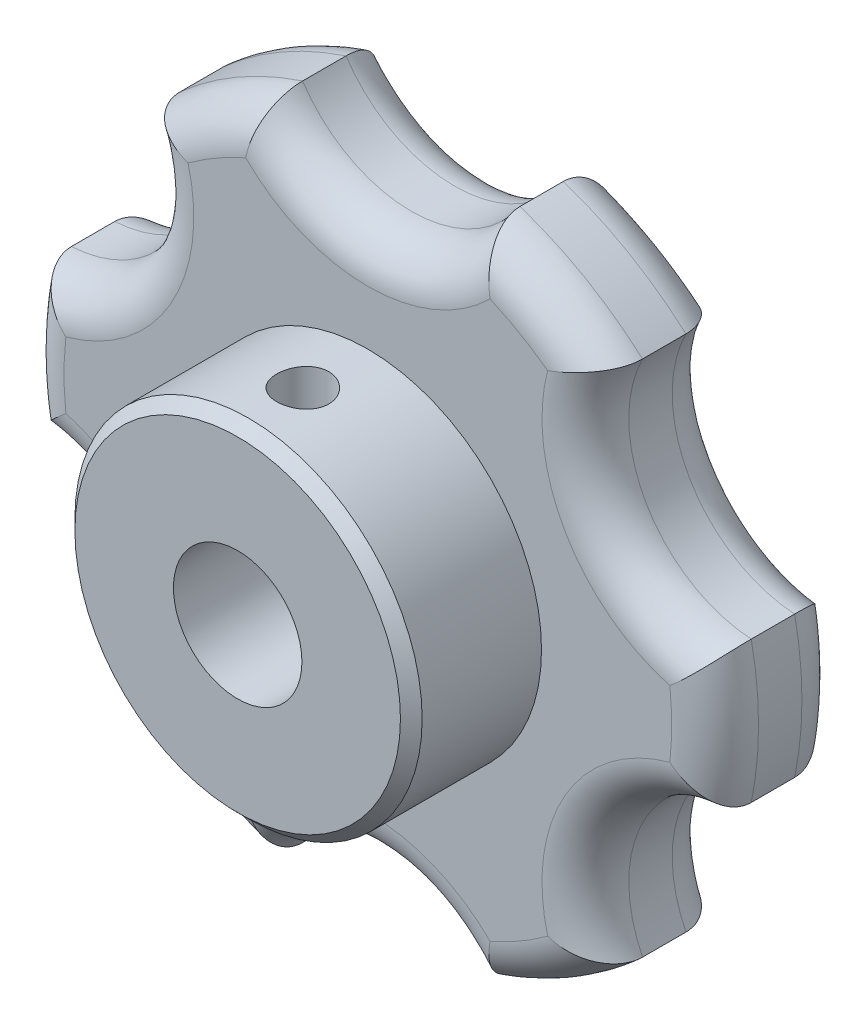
ISO-10303-21;
HEADER;
FILE_DESCRIPTION(('STEP AP214'),'2;1');
FILE_NAME('part.step','',(''),(''),'','','');
FILE_SCHEMA(('AUTOMOTIVE_DESIGN { 1 0 10303 214 1 1 1 1 }'));
ENDSEC;
DATA;
#1=APPLICATION_CONTEXT('core data for automotive mechanical design processes');
#2=APPLICATION_PROTOCOL_DEFINITION('international standard','automotive_design',2000,#1);
#3=PRODUCT_CONTEXT('',#1,'mechanical');
#4=PRODUCT('Part','Part','',(#3));
#5=PRODUCT_RELATED_PRODUCT_CATEGORY('part','',(#4));
#6=PRODUCT_DEFINITION_FORMATION('','',#4);
#7=PRODUCT_DEFINITION_CONTEXT('part definition',#1,'design');
#8=PRODUCT_DEFINITION('design','',#6,#7);
#9=PRODUCT_DEFINITION_SHAPE('','',#8);
#10=(LENGTH_UNIT() NAMED_UNIT(*) SI_UNIT(.MILLI.,.METRE.));
#11=(NAMED_UNIT(*) PLANE_ANGLE_UNIT() SI_UNIT($,.RADIAN.));
#12=(NAMED_UNIT(*) SI_UNIT($,.STERADIAN.) SOLID_ANGLE_UNIT());
#13=UNCERTAINTY_MEASURE_WITH_UNIT(LENGTH_MEASURE(1.E-05),#10,'distance_accuracy_value','');
#14=(GEOMETRIC_REPRESENTATION_CONTEXT(3) GLOBAL_UNCERTAINTY_ASSIGNED_CONTEXT((#13)) GLOBAL_UNIT_ASSIGNED_CONTEXT((#10,
#11,#12)) REPRESENTATION_CONTEXT('',''));
#15=CARTESIAN_POINT('',(0.,0.,0.));
#16=DIRECTION('',(0.,0.,1.));
#17=DIRECTION('',(1.,0.,0.));
#18=AXIS2_PLACEMENT_3D('',#15,#16,#17);
#19=CARTESIAN_POINT('',(0.,0.,19.05));
#20=DIRECTION('',(0.,0.,1.));
#21=DIRECTION('',(1.,0.,0.));
#22=AXIS2_PLACEMENT_3D('',#19,#20,#21);
#23=PLANE('',#22);
#24=CARTESIAN_POINT('',(0.,0.,19.05));
#25=DIRECTION('',(0.,0.,1.));
#26=DIRECTION('',(1.,0.,0.));
#27=AXIS2_PLACEMENT_3D('',#24,#25,#26);
#28=CIRCLE('',#27,11.90625);
#29=CARTESIAN_POINT('',(11.90625,0.,19.05));
#30=VERTEX_POINT('',#29);
#31=EDGE_CURVE('E46',#30,#30,#28,.T.);
#32=ORIENTED_EDGE('',*,*,#31,.T.);
#33=EDGE_LOOP('',(#32));
#34=FACE_BOUND('',#33,.T.);
#35=CARTESIAN_POINT('',(0.,0.,19.05));
#36=DIRECTION('',(0.,0.,1.));
#37=DIRECTION('',(1.,0.,0.));
#38=AXIS2_PLACEMENT_3D('',#35,#36,#37);
#39=CIRCLE('',#38,4.699);
#40=CARTESIAN_POINT('',(4.699,0.,19.05));
#41=VERTEX_POINT('',#40);
#42=EDGE_CURVE('E532',#41,#41,#39,.T.);
#43=ORIENTED_EDGE('',*,*,#42,.F.);
#44=EDGE_LOOP('',(#43));
#45=FACE_BOUND('',#44,.T.);
#46=ADVANCED_FACE('F38',(#34,#45),#23,.T.);
#47=CARTESIAN_POINT('',(0.,0.,9.525));
#48=DIRECTION('',(0.,0.,1.));
#49=DIRECTION('',(1.,0.,0.));
#50=AXIS2_PLACEMENT_3D('',#47,#48,#49);
#51=PLANE('',#50);
#52=CARTESIAN_POINT('',(0.,0.,9.525));
#53=DIRECTION('',(0.,0.,1.));
#54=DIRECTION('',(1.,0.,0.));
#55=AXIS2_PLACEMENT_3D('',#52,#53,#54);
#56=CIRCLE('',#55,22.225);
#57=CARTESIAN_POINT('',(13.1520552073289,17.9157491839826,9.525));
#58=VERTEX_POINT('',#57);
#59=CARTESIAN_POINT('',(8.93946631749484,20.3478885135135,9.525));
#60=VERTEX_POINT('',#59);
#61=EDGE_CURVE('E636',#58,#60,#56,.T.);
#62=ORIENTED_EDGE('',*,*,#61,.T.);
#63=CARTESIAN_POINT('',(0.,29.36875,9.525));
#64=DIRECTION('',(0.,0.,1.));
#65=DIRECTION('',(1.,0.,0.));
#66=AXIS2_PLACEMENT_3D('',#63,#64,#65);
#67=CIRCLE('',#66,12.7);
#68=CARTESIAN_POINT('',(-8.93946631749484,20.3478885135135,9.525));
#69=VERTEX_POINT('',#68);
#70=EDGE_CURVE('E633',#60,#69,#67,.F.);
#71=ORIENTED_EDGE('',*,*,#70,.T.);
#72=CARTESIAN_POINT('',(0.,0.,9.525));
#73=DIRECTION('',(0.,0.,1.));
#74=DIRECTION('',(1.,0.,0.));
#75=AXIS2_PLACEMENT_3D('',#72,#73,#74);
#76=CIRCLE('',#75,22.225);
#77=CARTESIAN_POINT('',(-13.1520552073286,17.9157491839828,9.525));
#78=VERTEX_POINT('',#77);
#79=EDGE_CURVE('E656',#69,#78,#76,.T.);
#80=ORIENTED_EDGE('',*,*,#79,.T.);
#81=CARTESIAN_POINT('',(-25.4340835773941,14.6843750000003,9.525));
#82=DIRECTION('',(0.,0.,1.));
#83=DIRECTION('',(1.,0.,0.));
#84=AXIS2_PLACEMENT_3D('',#81,#82,#83);
#85=CIRCLE('',#84,12.7);
#86=CARTESIAN_POINT('',(-22.0915215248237,2.43213932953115,9.525));
#87=VERTEX_POINT('',#86);
#88=EDGE_CURVE('E654',#78,#87,#85,.F.);
#89=ORIENTED_EDGE('',*,*,#88,.T.);
#90=CARTESIAN_POINT('',(0.,0.,9.525));
#91=DIRECTION('',(0.,0.,1.));
#92=DIRECTION('',(1.,0.,0.));
#93=AXIS2_PLACEMENT_3D('',#90,#91,#92);
#94=CIRCLE('',#93,22.225);
#95=CARTESIAN_POINT('',(-22.0915215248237,-2.43213932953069,9.525));
#96=VERTEX_POINT('',#95);
#97=EDGE_CURVE('E652',#87,#96,#94,.T.);
#98=ORIENTED_EDGE('',*,*,#97,.T.);
#99=CARTESIAN_POINT('',(-25.4340835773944,-14.6843749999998,9.525));
#100=DIRECTION('',(0.,0.,1.));
#101=DIRECTION('',(1.,0.,0.));
#102=AXIS2_PLACEMENT_3D('',#99,#100,#101);
#103=CIRCLE('',#102,12.7);
#104=CARTESIAN_POINT('',(-13.152055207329,-17.9157491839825,9.525));
#105=VERTEX_POINT('',#104);
#106=EDGE_CURVE('E650',#96,#105,#103,.F.);
#107=ORIENTED_EDGE('',*,*,#106,.T.);
#108=CARTESIAN_POINT('',(0.,0.,9.525));
#109=DIRECTION('',(0.,0.,1.));
#110=DIRECTION('',(1.,0.,0.));
#111=AXIS2_PLACEMENT_3D('',#108,#109,#110);
#112=CIRCLE('',#111,22.225);
#113=CARTESIAN_POINT('',(-8.93946631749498,-20.3478885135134,9.525));
#114=VERTEX_POINT('',#113);
#115=EDGE_CURVE('E648',#105,#114,#112,.T.);
#116=ORIENTED_EDGE('',*,*,#115,.T.);
#117=CARTESIAN_POINT('',(-2.05081003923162E-13,-29.36875,9.525));
#118=DIRECTION('',(0.,0.,1.));
#119=DIRECTION('',(1.,0.,0.));
#120=AXIS2_PLACEMENT_3D('',#117,#118,#119);
#121=CIRCLE('',#120,12.7);
#122=CARTESIAN_POINT('',(8.9394663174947,-20.3478885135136,9.525));
#123=VERTEX_POINT('',#122);
#124=EDGE_CURVE('E646',#114,#123,#121,.F.);
#125=ORIENTED_EDGE('',*,*,#124,.T.);
#126=CARTESIAN_POINT('',(0.,0.,9.525));
#127=DIRECTION('',(0.,0.,1.));
#128=DIRECTION('',(1.,0.,0.));
#129=AXIS2_PLACEMENT_3D('',#126,#127,#128);
#130=CIRCLE('',#129,22.225);
#131=CARTESIAN_POINT('',(13.1520552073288,-17.9157491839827,9.525));
#132=VERTEX_POINT('',#131);
#133=EDGE_CURVE('E644',#123,#132,#130,.T.);
#134=ORIENTED_EDGE('',*,*,#133,.T.);
#135=CARTESIAN_POINT('',(25.4340835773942,-14.6843750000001,9.525));
#136=DIRECTION('',(0.,0.,1.));
#137=DIRECTION('',(1.,0.,0.));
#138=AXIS2_PLACEMENT_3D('',#135,#136,#137);
#139=CIRCLE('',#138,12.7);
#140=CARTESIAN_POINT('',(22.0915215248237,-2.432139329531,9.525));
#141=VERTEX_POINT('',#140);
#142=EDGE_CURVE('E642',#132,#141,#139,.F.);
#143=ORIENTED_EDGE('',*,*,#142,.T.);
#144=CARTESIAN_POINT('',(0.,0.,9.525));
#145=DIRECTION('',(0.,0.,1.));
#146=DIRECTION('',(1.,0.,0.));
#147=AXIS2_PLACEMENT_3D('',#144,#145,#146);
#148=CIRCLE('',#147,22.225);
#149=CARTESIAN_POINT('',(22.0915215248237,2.43213932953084,9.525));
#150=VERTEX_POINT('',#149);
#151=EDGE_CURVE('E640',#141,#150,#148,.T.);
#152=ORIENTED_EDGE('',*,*,#151,.T.);
#153=CARTESIAN_POINT('',(25.4340835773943,14.6843749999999,9.525));
#154=DIRECTION('',(0.,0.,1.));
#155=DIRECTION('',(1.,0.,0.));
#156=AXIS2_PLACEMENT_3D('',#153,#154,#155);
#157=CIRCLE('',#156,12.7);
#158=EDGE_CURVE('E638',#150,#58,#157,.F.);
#159=ORIENTED_EDGE('',*,*,#158,.T.);
#160=EDGE_LOOP('',(#62,#71,#80,#89,#98,#107,#116,#125,#134,#143,#152,#159));
#161=FACE_BOUND('',#160,.T.);
#162=CARTESIAN_POINT('',(0.,0.,9.525));
#163=DIRECTION('',(0.,0.,1.));
#164=DIRECTION('',(1.,0.,0.));
#165=AXIS2_PLACEMENT_3D('',#162,#163,#164);
#166=CIRCLE('',#165,12.7);
#167=CARTESIAN_POINT('',(12.7,0.,9.525));
#168=VERTEX_POINT('',#167);
#169=EDGE_CURVE('E527',#168,#168,#166,.T.);
#170=ORIENTED_EDGE('',*,*,#169,.F.);
#171=EDGE_LOOP('',(#170));
#172=FACE_BOUND('',#171,.T.);
#173=ADVANCED_FACE('F220',(#161,#172),#51,.T.);
#174=CARTESIAN_POINT('',(0.,0.,9.525));
#175=DIRECTION('',(0.,0.,-1.));
#176=DIRECTION('',(-1.,0.,0.));
#177=AXIS2_PLACEMENT_3D('',#174,#175,#176);
#178=CYLINDRICAL_SURFACE('',#177,25.4);
#179=DIRECTION('',(0.,0.,-1.));
#180=VECTOR('',#179,1.);
#181=CARTESIAN_POINT('',(-7.95070127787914,24.1235641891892,4.7625));
#182=LINE('',#181,#180);
#183=CARTESIAN_POINT('',(-7.95070127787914,24.1235641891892,3.175));
#184=VERTEX_POINT('',#183);
#185=CARTESIAN_POINT('',(-7.95070127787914,24.1235641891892,6.35));
#186=VERTEX_POINT('',#185);
#187=EDGE_CURVE('E663',#184,#186,#182,.F.);
#188=ORIENTED_EDGE('',*,*,#187,.F.);
#189=CARTESIAN_POINT('',(0.,0.,3.175));
#190=DIRECTION('',(0.,0.,1.));
#191=DIRECTION('',(1.,0.,0.));
#192=AXIS2_PLACEMENT_3D('',#189,#190,#191);
#193=CIRCLE('',#192,25.4);
#194=CARTESIAN_POINT('',(-16.9162687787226,18.9472913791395,3.175));
#195=VERTEX_POINT('',#194);
#196=EDGE_CURVE('E53',#184,#195,#193,.T.);
#197=ORIENTED_EDGE('',*,*,#196,.T.);
#198=DIRECTION('',(0.,0.,-1.));
#199=VECTOR('',#198,1.);
#200=CARTESIAN_POINT('',(-16.9162687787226,18.9472913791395,4.7625));
#201=LINE('',#200,#199);
#202=CARTESIAN_POINT('',(-16.9162687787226,18.9472913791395,6.35));
#203=VERTEX_POINT('',#202);
#204=EDGE_CURVE('E685',#203,#195,#201,.T.);
#205=ORIENTED_EDGE('',*,*,#204,.F.);
#206=CARTESIAN_POINT('',(0.,0.,6.35));
#207=DIRECTION('',(0.,0.,1.));
#208=DIRECTION('',(1.,0.,0.));
#209=AXIS2_PLACEMENT_3D('',#206,#207,#208);
#210=CIRCLE('',#209,25.4);
#211=EDGE_CURVE('E605',#203,#186,#210,.F.);
#212=ORIENTED_EDGE('',*,*,#211,.T.);
#213=EDGE_LOOP('',(#188,#197,#205,#212));
#214=FACE_BOUND('',#213,.T.);
#215=ADVANCED_FACE('F40',(#214),#178,.T.);
#216=DIRECTION('',(0.,0.,-1.));
#217=VECTOR('',#216,1.);
#218=CARTESIAN_POINT('',(-24.8669700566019,5.17627281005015,4.7625));
#219=LINE('',#218,#217);
#220=CARTESIAN_POINT('',(-24.8669700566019,5.17627281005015,3.175));
#221=VERTEX_POINT('',#220);
#222=CARTESIAN_POINT('',(-24.8669700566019,5.17627281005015,6.35));
#223=VERTEX_POINT('',#222);
#224=EDGE_CURVE('E686',#221,#223,#219,.F.);
#225=ORIENTED_EDGE('',*,*,#224,.F.);
#226=CARTESIAN_POINT('',(0.,0.,3.175));
#227=DIRECTION('',(0.,0.,1.));
#228=DIRECTION('',(1.,0.,0.));
#229=AXIS2_PLACEMENT_3D('',#226,#227,#228);
#230=CIRCLE('',#229,25.4);
#231=CARTESIAN_POINT('',(-24.866970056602,-5.17627281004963,3.175));
#232=VERTEX_POINT('',#231);
#233=EDGE_CURVE('E603',#221,#232,#230,.T.);
#234=ORIENTED_EDGE('',*,*,#233,.T.);
#235=DIRECTION('',(0.,0.,-1.));
#236=VECTOR('',#235,1.);
#237=CARTESIAN_POINT('',(-24.866970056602,-5.17627281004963,4.7625));
#238=LINE('',#237,#236);
#239=CARTESIAN_POINT('',(-24.866970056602,-5.17627281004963,6.35));
#240=VERTEX_POINT('',#239);
#241=EDGE_CURVE('E680',#240,#232,#238,.T.);
#242=ORIENTED_EDGE('',*,*,#241,.F.);
#243=CARTESIAN_POINT('',(0.,0.,6.35));
#244=DIRECTION('',(0.,0.,1.));
#245=DIRECTION('',(1.,0.,0.));
#246=AXIS2_PLACEMENT_3D('',#243,#244,#245);
#247=CIRCLE('',#246,25.4);
#248=EDGE_CURVE('E610',#240,#223,#247,.F.);
#249=ORIENTED_EDGE('',*,*,#248,.T.);
#250=EDGE_LOOP('',(#225,#234,#242,#249));
#251=FACE_BOUND('',#250,.T.);
#252=ADVANCED_FACE('F500',(#251),#178,.T.);
#253=CARTESIAN_POINT('',(0.,0.,0.));
#254=DIRECTION('',(0.,0.,1.));
#255=DIRECTION('',(1.,0.,0.));
#256=AXIS2_PLACEMENT_3D('',#253,#254,#255);
#257=PLANE('',#256);
#258=CARTESIAN_POINT('',(-25.4340835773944,-14.6843749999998,0.));
#259=DIRECTION('',(0.,0.,1.));
#260=DIRECTION('',(1.,0.,0.));
#261=AXIS2_PLACEMENT_3D('',#258,#259,#260);
#262=CIRCLE('',#261,12.7);
#263=CARTESIAN_POINT('',(-13.152055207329,-17.9157491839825,0.));
#264=VERTEX_POINT('',#263);
#265=CARTESIAN_POINT('',(-22.0915215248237,-2.43213932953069,0.));
#266=VERTEX_POINT('',#265);
#267=EDGE_CURVE('E511',#264,#266,#262,.T.);
#268=ORIENTED_EDGE('',*,*,#267,.T.);
#269=CARTESIAN_POINT('',(0.,0.,0.));
#270=DIRECTION('',(0.,0.,1.));
#271=DIRECTION('',(1.,0.,0.));
#272=AXIS2_PLACEMENT_3D('',#269,#270,#271);
#273=CIRCLE('',#272,22.225);
#274=CARTESIAN_POINT('',(-22.0915215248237,2.43213932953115,0.));
#275=VERTEX_POINT('',#274);
#276=EDGE_CURVE('E513',#266,#275,#273,.F.);
#277=ORIENTED_EDGE('',*,*,#276,.T.);
#278=CARTESIAN_POINT('',(-25.4340835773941,14.6843750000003,0.));
#279=DIRECTION('',(0.,0.,1.));
#280=DIRECTION('',(1.,0.,0.));
#281=AXIS2_PLACEMENT_3D('',#278,#279,#280);
#282=CIRCLE('',#281,12.7);
#283=CARTESIAN_POINT('',(-13.1520552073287,17.9157491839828,0.));
#284=VERTEX_POINT('',#283);
#285=EDGE_CURVE('E601',#275,#284,#282,.T.);
#286=ORIENTED_EDGE('',*,*,#285,.T.);
#287=CARTESIAN_POINT('',(0.,0.,0.));
#288=DIRECTION('',(0.,0.,1.));
#289=DIRECTION('',(1.,0.,0.));
#290=AXIS2_PLACEMENT_3D('',#287,#288,#289);
#291=CIRCLE('',#290,22.225);
#292=CARTESIAN_POINT('',(-8.93946631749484,20.3478885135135,0.));
#293=VERTEX_POINT('',#292);
#294=EDGE_CURVE('E599',#284,#293,#291,.F.);
#295=ORIENTED_EDGE('',*,*,#294,.T.);
#296=CARTESIAN_POINT('',(0.,29.36875,0.));
#297=DIRECTION('',(0.,0.,1.));
#298=DIRECTION('',(1.,0.,0.));
#299=AXIS2_PLACEMENT_3D('',#296,#297,#298);
#300=CIRCLE('',#299,12.7);
#301=CARTESIAN_POINT('',(8.93946631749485,20.3478885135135,0.));
#302=VERTEX_POINT('',#301);
#303=EDGE_CURVE('E597',#293,#302,#300,.T.);
#304=ORIENTED_EDGE('',*,*,#303,.T.);
#305=CARTESIAN_POINT('',(0.,0.,0.));
#306=DIRECTION('',(0.,0.,1.));
#307=DIRECTION('',(1.,0.,0.));
#308=AXIS2_PLACEMENT_3D('',#305,#306,#307);
#309=CIRCLE('',#308,22.225);
#310=CARTESIAN_POINT('',(13.1520552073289,17.9157491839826,0.));
#311=VERTEX_POINT('',#310);
#312=EDGE_CURVE('E595',#302,#311,#309,.F.);
#313=ORIENTED_EDGE('',*,*,#312,.T.);
#314=CARTESIAN_POINT('',(25.4340835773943,14.6843749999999,0.));
#315=DIRECTION('',(0.,0.,1.));
#316=DIRECTION('',(1.,0.,0.));
#317=AXIS2_PLACEMENT_3D('',#314,#315,#316);
#318=CIRCLE('',#317,12.7);
#319=CARTESIAN_POINT('',(22.0915215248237,2.43213932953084,0.));
#320=VERTEX_POINT('',#319);
#321=EDGE_CURVE('E593',#311,#320,#318,.T.);
#322=ORIENTED_EDGE('',*,*,#321,.T.);
#323=CARTESIAN_POINT('',(0.,0.,0.));
#324=DIRECTION('',(0.,0.,1.));
#325=DIRECTION('',(1.,0.,0.));
#326=AXIS2_PLACEMENT_3D('',#323,#324,#325);
#327=CIRCLE('',#326,22.225);
#328=CARTESIAN_POINT('',(22.0915215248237,-2.432139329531,0.));
#329=VERTEX_POINT('',#328);
#330=EDGE_CURVE('E591',#320,#329,#327,.F.);
#331=ORIENTED_EDGE('',*,*,#330,.T.);
#332=CARTESIAN_POINT('',(25.4340835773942,-14.6843750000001,0.));
#333=DIRECTION('',(0.,0.,1.));
#334=DIRECTION('',(1.,0.,0.));
#335=AXIS2_PLACEMENT_3D('',#332,#333,#334);
#336=CIRCLE('',#335,12.7);
#337=CARTESIAN_POINT('',(13.1520552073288,-17.9157491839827,0.));
#338=VERTEX_POINT('',#337);
#339=EDGE_CURVE('E589',#329,#338,#336,.T.);
#340=ORIENTED_EDGE('',*,*,#339,.T.);
#341=CARTESIAN_POINT('',(0.,0.,0.));
#342=DIRECTION('',(0.,0.,1.));
#343=DIRECTION('',(1.,0.,0.));
#344=AXIS2_PLACEMENT_3D('',#341,#342,#343);
#345=CIRCLE('',#344,22.225);
#346=CARTESIAN_POINT('',(8.9394663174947,-20.3478885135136,0.));
#347=VERTEX_POINT('',#346);
#348=EDGE_CURVE('E587',#338,#347,#345,.F.);
#349=ORIENTED_EDGE('',*,*,#348,.T.);
#350=CARTESIAN_POINT('',(-2.05081003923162E-13,-29.36875,0.));
#351=DIRECTION('',(0.,0.,1.));
#352=DIRECTION('',(1.,0.,0.));
#353=AXIS2_PLACEMENT_3D('',#350,#351,#352);
#354=CIRCLE('',#353,12.7);
#355=CARTESIAN_POINT('',(-8.93946631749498,-20.3478885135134,0.));
#356=VERTEX_POINT('',#355);
#357=EDGE_CURVE('E585',#347,#356,#354,.T.);
#358=ORIENTED_EDGE('',*,*,#357,.T.);
#359=CARTESIAN_POINT('',(0.,0.,0.));
#360=DIRECTION('',(0.,0.,1.));
#361=DIRECTION('',(1.,0.,0.));
#362=AXIS2_PLACEMENT_3D('',#359,#360,#361);
#363=CIRCLE('',#362,22.225);
#364=EDGE_CURVE('E515',#356,#264,#363,.F.);
#365=ORIENTED_EDGE('',*,*,#364,.T.);
#366=EDGE_LOOP('',(#268,#277,#286,#295,#304,#313,#322,#331,#340,#349,#358,#365));
#367=FACE_BOUND('',#366,.T.);
#368=ADVANCED_FACE('F497',(#367),#257,.F.);
#369=DIRECTION('',(0.,0.,-1.));
#370=VECTOR('',#369,1.);
#371=CARTESIAN_POINT('',(-16.916268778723,-18.9472913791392,4.7625));
#372=LINE('',#371,#370);
#373=CARTESIAN_POINT('',(-16.916268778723,-18.9472913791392,3.175));
#374=VERTEX_POINT('',#373);
#375=CARTESIAN_POINT('',(-16.916268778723,-18.9472913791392,6.35));
#376=VERTEX_POINT('',#375);
#377=EDGE_CURVE('E683',#374,#376,#372,.F.);
#378=ORIENTED_EDGE('',*,*,#377,.F.);
#379=CARTESIAN_POINT('',(0.,0.,3.175));
#380=DIRECTION('',(0.,0.,1.));
#381=DIRECTION('',(1.,0.,0.));
#382=AXIS2_PLACEMENT_3D('',#379,#380,#381);
#383=CIRCLE('',#382,25.4);
#384=CARTESIAN_POINT('',(-7.9507012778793,-24.1235641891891,3.175));
#385=VERTEX_POINT('',#384);
#386=EDGE_CURVE('E581',#374,#385,#383,.T.);
#387=ORIENTED_EDGE('',*,*,#386,.T.);
#388=DIRECTION('',(0.,0.,-1.));
#389=VECTOR('',#388,1.);
#390=CARTESIAN_POINT('',(-7.9507012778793,-24.1235641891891,4.7625));
#391=LINE('',#390,#389);
#392=CARTESIAN_POINT('',(-7.9507012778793,-24.1235641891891,6.35));
#393=VERTEX_POINT('',#392);
#394=EDGE_CURVE('E675',#393,#385,#391,.T.);
#395=ORIENTED_EDGE('',*,*,#394,.F.);
#396=CARTESIAN_POINT('',(0.,0.,6.35));
#397=DIRECTION('',(0.,0.,1.));
#398=DIRECTION('',(1.,0.,0.));
#399=AXIS2_PLACEMENT_3D('',#396,#397,#398);
#400=CIRCLE('',#399,25.4);
#401=EDGE_CURVE('E615',#393,#376,#400,.F.);
#402=ORIENTED_EDGE('',*,*,#401,.T.);
#403=EDGE_LOOP('',(#378,#387,#395,#402));
#404=FACE_BOUND('',#403,.T.);
#405=ADVANCED_FACE('F499',(#404),#178,.T.);
#406=DIRECTION('',(0.,0.,-1.));
#407=VECTOR('',#406,1.);
#408=CARTESIAN_POINT('',(7.95070127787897,-24.1235641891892,4.7625));
#409=LINE('',#408,#407);
#410=CARTESIAN_POINT('',(7.95070127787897,-24.1235641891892,3.175));
#411=VERTEX_POINT('',#410);
#412=CARTESIAN_POINT('',(7.95070127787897,-24.1235641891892,6.35));
#413=VERTEX_POINT('',#412);
#414=EDGE_CURVE('E678',#411,#413,#409,.F.);
#415=ORIENTED_EDGE('',*,*,#414,.F.);
#416=CARTESIAN_POINT('',(0.,0.,3.175));
#417=DIRECTION('',(0.,0.,1.));
#418=DIRECTION('',(1.,0.,0.));
#419=AXIS2_PLACEMENT_3D('',#416,#417,#418);
#420=CIRCLE('',#419,25.4);
#421=CARTESIAN_POINT('',(16.9162687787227,-18.9472913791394,3.175));
#422=VERTEX_POINT('',#421);
#423=EDGE_CURVE('E577',#411,#422,#420,.T.);
#424=ORIENTED_EDGE('',*,*,#423,.T.);
#425=DIRECTION('',(0.,0.,-1.));
#426=VECTOR('',#425,1.);
#427=CARTESIAN_POINT('',(16.9162687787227,-18.9472913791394,4.7625));
#428=LINE('',#427,#426);
#429=CARTESIAN_POINT('',(16.9162687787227,-18.9472913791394,6.35));
#430=VERTEX_POINT('',#429);
#431=EDGE_CURVE('E670',#430,#422,#428,.T.);
#432=ORIENTED_EDGE('',*,*,#431,.F.);
#433=CARTESIAN_POINT('',(0.,0.,6.35));
#434=DIRECTION('',(0.,0.,1.));
#435=DIRECTION('',(1.,0.,0.));
#436=AXIS2_PLACEMENT_3D('',#433,#434,#435);
#437=CIRCLE('',#436,25.4);
#438=EDGE_CURVE('E620',#430,#413,#437,.F.);
#439=ORIENTED_EDGE('',*,*,#438,.T.);
#440=EDGE_LOOP('',(#415,#424,#432,#439));
#441=FACE_BOUND('',#440,.T.);
#442=ADVANCED_FACE('F506',(#441),#178,.T.);
#443=DIRECTION('',(0.,0.,-1.));
#444=VECTOR('',#443,1.);
#445=CARTESIAN_POINT('',(24.8669700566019,-5.17627281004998,4.7625));
#446=LINE('',#445,#444);
#447=CARTESIAN_POINT('',(24.8669700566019,-5.17627281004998,3.175));
#448=VERTEX_POINT('',#447);
#449=CARTESIAN_POINT('',(24.8669700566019,-5.17627281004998,6.35));
#450=VERTEX_POINT('',#449);
#451=EDGE_CURVE('E673',#448,#450,#446,.F.);
#452=ORIENTED_EDGE('',*,*,#451,.F.);
#453=CARTESIAN_POINT('',(0.,0.,3.175));
#454=DIRECTION('',(0.,0.,1.));
#455=DIRECTION('',(1.,0.,0.));
#456=AXIS2_PLACEMENT_3D('',#453,#454,#455);
#457=CIRCLE('',#456,25.4);
#458=CARTESIAN_POINT('',(24.866970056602,5.17627281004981,3.175));
#459=VERTEX_POINT('',#458);
#460=EDGE_CURVE('E573',#448,#459,#457,.T.);
#461=ORIENTED_EDGE('',*,*,#460,.T.);
#462=DIRECTION('',(0.,0.,-1.));
#463=VECTOR('',#462,1.);
#464=CARTESIAN_POINT('',(24.866970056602,5.17627281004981,4.7625));
#465=LINE('',#464,#463);
#466=CARTESIAN_POINT('',(24.866970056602,5.17627281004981,6.35));
#467=VERTEX_POINT('',#466);
#468=EDGE_CURVE('E665',#467,#459,#465,.T.);
#469=ORIENTED_EDGE('',*,*,#468,.F.);
#470=CARTESIAN_POINT('',(0.,0.,6.35));
#471=DIRECTION('',(0.,0.,1.));
#472=DIRECTION('',(1.,0.,0.));
#473=AXIS2_PLACEMENT_3D('',#470,#471,#472);
#474=CIRCLE('',#473,25.4);
#475=EDGE_CURVE('E625',#467,#450,#474,.F.);
#476=ORIENTED_EDGE('',*,*,#475,.T.);
#477=EDGE_LOOP('',(#452,#461,#469,#476));
#478=FACE_BOUND('',#477,.T.);
#479=ADVANCED_FACE('F739',(#478),#178,.T.);
#480=DIRECTION('',(0.,0.,-1.));
#481=VECTOR('',#480,1.);
#482=CARTESIAN_POINT('',(16.9162687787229,18.9472913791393,4.7625));
#483=LINE('',#482,#481);
#484=CARTESIAN_POINT('',(16.9162687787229,18.9472913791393,3.175));
#485=VERTEX_POINT('',#484);
#486=CARTESIAN_POINT('',(16.9162687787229,18.9472913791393,6.35));
#487=VERTEX_POINT('',#486);
#488=EDGE_CURVE('E668',#485,#487,#483,.F.);
#489=ORIENTED_EDGE('',*,*,#488,.F.);
#490=CARTESIAN_POINT('',(0.,0.,3.175));
#491=DIRECTION('',(0.,0.,1.));
#492=DIRECTION('',(1.,0.,0.));
#493=AXIS2_PLACEMENT_3D('',#490,#491,#492);
#494=CIRCLE('',#493,25.4);
#495=CARTESIAN_POINT('',(7.95070127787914,24.1235641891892,3.175));
#496=VERTEX_POINT('',#495);
#497=EDGE_CURVE('E569',#485,#496,#494,.T.);
#498=ORIENTED_EDGE('',*,*,#497,.T.);
#499=DIRECTION('',(0.,0.,-1.));
#500=VECTOR('',#499,1.);
#501=CARTESIAN_POINT('',(7.95070127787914,24.1235641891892,4.7625));
#502=LINE('',#501,#500);
#503=CARTESIAN_POINT('',(7.95070127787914,24.1235641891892,6.35));
#504=VERTEX_POINT('',#503);
#505=EDGE_CURVE('E661',#504,#496,#502,.T.);
#506=ORIENTED_EDGE('',*,*,#505,.F.);
#507=CARTESIAN_POINT('',(0.,0.,6.35));
#508=DIRECTION('',(0.,0.,1.));
#509=DIRECTION('',(1.,0.,0.));
#510=AXIS2_PLACEMENT_3D('',#507,#508,#509);
#511=CIRCLE('',#510,25.4);
#512=EDGE_CURVE('E630',#504,#487,#511,.F.);
#513=ORIENTED_EDGE('',*,*,#512,.T.);
#514=EDGE_LOOP('',(#489,#498,#506,#513));
#515=FACE_BOUND('',#514,.T.);
#516=ADVANCED_FACE('F496',(#515),#178,.T.);
#517=CARTESIAN_POINT('',(0.,29.36875,9.525));
#518=DIRECTION('',(0.,0.,-1.));
#519=DIRECTION('',(-1.,0.,0.));
#520=AXIS2_PLACEMENT_3D('',#517,#518,#519);
#521=CYLINDRICAL_SURFACE('',#520,9.525);
#522=ORIENTED_EDGE('',*,*,#505,.T.);
#523=CARTESIAN_POINT('',(0.,29.36875,3.175));
#524=DIRECTION('',(0.,0.,1.));
#525=DIRECTION('',(1.,0.,0.));
#526=AXIS2_PLACEMENT_3D('',#523,#524,#525);
#527=CIRCLE('',#526,9.525);
#528=EDGE_CURVE('E61',#496,#184,#527,.F.);
#529=ORIENTED_EDGE('',*,*,#528,.T.);
#530=ORIENTED_EDGE('',*,*,#187,.T.);
#531=CARTESIAN_POINT('',(0.,29.36875,6.35));
#532=DIRECTION('',(0.,0.,1.));
#533=DIRECTION('',(1.,0.,0.));
#534=AXIS2_PLACEMENT_3D('',#531,#532,#533);
#535=CIRCLE('',#534,9.525);
#536=EDGE_CURVE('E658',#186,#504,#535,.T.);
#537=ORIENTED_EDGE('',*,*,#536,.T.);
#538=EDGE_LOOP('',(#522,#529,#530,#537));
#539=FACE_BOUND('',#538,.T.);
#540=ADVANCED_FACE('F492',(#539),#521,.F.);
#541=CARTESIAN_POINT('',(25.4340835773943,14.6843749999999,9.525));
#542=DIRECTION('',(0.,0.,-1.));
#543=DIRECTION('',(-1.,0.,0.));
#544=AXIS2_PLACEMENT_3D('',#541,#542,#543);
#545=CYLINDRICAL_SURFACE('',#544,9.525);
#546=ORIENTED_EDGE('',*,*,#468,.T.);
#547=CARTESIAN_POINT('',(25.4340835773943,14.6843749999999,3.175));
#548=DIRECTION('',(0.,0.,1.));
#549=DIRECTION('',(1.,0.,0.));
#550=AXIS2_PLACEMENT_3D('',#547,#548,#549);
#551=CIRCLE('',#550,9.525);
#552=EDGE_CURVE('E571',#459,#485,#551,.F.);
#553=ORIENTED_EDGE('',*,*,#552,.T.);
#554=ORIENTED_EDGE('',*,*,#488,.T.);
#555=CARTESIAN_POINT('',(25.4340835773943,14.6843749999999,6.35));
#556=DIRECTION('',(0.,0.,1.));
#557=DIRECTION('',(1.,0.,0.));
#558=AXIS2_PLACEMENT_3D('',#555,#556,#557);
#559=CIRCLE('',#558,9.525);
#560=EDGE_CURVE('E628',#487,#467,#559,.T.);
#561=ORIENTED_EDGE('',*,*,#560,.T.);
#562=EDGE_LOOP('',(#546,#553,#554,#561));
#563=FACE_BOUND('',#562,.T.);
#564=ADVANCED_FACE('F488',(#563),#545,.F.);
#565=CARTESIAN_POINT('',(25.4340835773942,-14.6843750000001,9.525));
#566=DIRECTION('',(0.,0.,-1.));
#567=DIRECTION('',(-1.,0.,0.));
#568=AXIS2_PLACEMENT_3D('',#565,#566,#567);
#569=CYLINDRICAL_SURFACE('',#568,9.525);
#570=ORIENTED_EDGE('',*,*,#431,.T.);
#571=CARTESIAN_POINT('',(25.4340835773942,-14.6843750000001,3.175));
#572=DIRECTION('',(0.,0.,1.));
#573=DIRECTION('',(1.,0.,0.));
#574=AXIS2_PLACEMENT_3D('',#571,#572,#573);
#575=CIRCLE('',#574,9.525);
#576=EDGE_CURVE('E575',#422,#448,#575,.F.);
#577=ORIENTED_EDGE('',*,*,#576,.T.);
#578=ORIENTED_EDGE('',*,*,#451,.T.);
#579=CARTESIAN_POINT('',(25.4340835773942,-14.6843750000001,6.35));
#580=DIRECTION('',(0.,0.,1.));
#581=DIRECTION('',(1.,0.,0.));
#582=AXIS2_PLACEMENT_3D('',#579,#580,#581);
#583=CIRCLE('',#582,9.525);
#584=EDGE_CURVE('E623',#450,#430,#583,.T.);
#585=ORIENTED_EDGE('',*,*,#584,.T.);
#586=EDGE_LOOP('',(#570,#577,#578,#585));
#587=FACE_BOUND('',#586,.T.);
#588=ADVANCED_FACE('F484',(#587),#569,.F.);
#589=CARTESIAN_POINT('',(-2.05081003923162E-13,-29.36875,9.525));
#590=DIRECTION('',(0.,0.,-1.));
#591=DIRECTION('',(-1.,0.,0.));
#592=AXIS2_PLACEMENT_3D('',#589,#590,#591);
#593=CYLINDRICAL_SURFACE('',#592,9.525);
#594=ORIENTED_EDGE('',*,*,#394,.T.);
#595=CARTESIAN_POINT('',(-2.05081003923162E-13,-29.36875,3.175));
#596=DIRECTION('',(0.,0.,1.));
#597=DIRECTION('',(1.,0.,0.));
#598=AXIS2_PLACEMENT_3D('',#595,#596,#597);
#599=CIRCLE('',#598,9.525);
#600=EDGE_CURVE('E579',#385,#411,#599,.F.);
#601=ORIENTED_EDGE('',*,*,#600,.T.);
#602=ORIENTED_EDGE('',*,*,#414,.T.);
#603=CARTESIAN_POINT('',(-2.05081003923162E-13,-29.36875,6.35));
#604=DIRECTION('',(0.,0.,1.));
#605=DIRECTION('',(1.,0.,0.));
#606=AXIS2_PLACEMENT_3D('',#603,#604,#605);
#607=CIRCLE('',#606,9.525);
#608=EDGE_CURVE('E618',#413,#393,#607,.T.);
#609=ORIENTED_EDGE('',*,*,#608,.T.);
#610=EDGE_LOOP('',(#594,#601,#602,#609));
#611=FACE_BOUND('',#610,.T.);
#612=ADVANCED_FACE('F480',(#611),#593,.F.);
#613=CARTESIAN_POINT('',(-25.4340835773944,-14.6843749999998,9.525));
#614=DIRECTION('',(0.,0.,-1.));
#615=DIRECTION('',(-1.,0.,0.));
#616=AXIS2_PLACEMENT_3D('',#613,#614,#615);
#617=CYLINDRICAL_SURFACE('',#616,9.525);
#618=ORIENTED_EDGE('',*,*,#241,.T.);
#619=CARTESIAN_POINT('',(-25.4340835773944,-14.6843749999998,3.175));
#620=DIRECTION('',(0.,0.,1.));
#621=DIRECTION('',(1.,0.,0.));
#622=AXIS2_PLACEMENT_3D('',#619,#620,#621);
#623=CIRCLE('',#622,9.525);
#624=EDGE_CURVE('E524',#232,#374,#623,.F.);
#625=ORIENTED_EDGE('',*,*,#624,.T.);
#626=ORIENTED_EDGE('',*,*,#377,.T.);
#627=CARTESIAN_POINT('',(-25.4340835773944,-14.6843749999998,6.35));
#628=DIRECTION('',(0.,0.,1.));
#629=DIRECTION('',(1.,0.,0.));
#630=AXIS2_PLACEMENT_3D('',#627,#628,#629);
#631=CIRCLE('',#630,9.525);
#632=EDGE_CURVE('E613',#376,#240,#631,.T.);
#633=ORIENTED_EDGE('',*,*,#632,.T.);
#634=EDGE_LOOP('',(#618,#625,#626,#633));
#635=FACE_BOUND('',#634,.T.);
#636=ADVANCED_FACE('F476',(#635),#617,.F.);
#637=CARTESIAN_POINT('',(-25.4340835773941,14.6843750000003,9.525));
#638=DIRECTION('',(0.,0.,-1.));
#639=DIRECTION('',(-1.,0.,0.));
#640=AXIS2_PLACEMENT_3D('',#637,#638,#639);
#641=CYLINDRICAL_SURFACE('',#640,9.525);
#642=ORIENTED_EDGE('',*,*,#204,.T.);
#643=CARTESIAN_POINT('',(-25.4340835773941,14.6843750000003,3.175));
#644=DIRECTION('',(0.,0.,1.));
#645=DIRECTION('',(1.,0.,0.));
#646=AXIS2_PLACEMENT_3D('',#643,#644,#645);
#647=CIRCLE('',#646,9.525);
#648=EDGE_CURVE('E564',#195,#221,#647,.F.);
#649=ORIENTED_EDGE('',*,*,#648,.T.);
#650=ORIENTED_EDGE('',*,*,#224,.T.);
#651=CARTESIAN_POINT('',(-25.4340835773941,14.6843750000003,6.35));
#652=DIRECTION('',(0.,0.,1.));
#653=DIRECTION('',(1.,0.,0.));
#654=AXIS2_PLACEMENT_3D('',#651,#652,#653);
#655=CIRCLE('',#654,9.525);
#656=EDGE_CURVE('E608',#223,#203,#655,.T.);
#657=ORIENTED_EDGE('',*,*,#656,.T.);
#658=EDGE_LOOP('',(#642,#649,#650,#657));
#659=FACE_BOUND('',#658,.T.);
#660=ADVANCED_FACE('F471',(#659),#641,.F.);
#661=CARTESIAN_POINT('',(-2.05081003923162E-13,-29.36875,6.35));
#662=DIRECTION('',(0.,0.,1.));
#663=DIRECTION('',(1.,0.,0.));
#664=AXIS2_PLACEMENT_3D('',#661,#662,#663);
#665=TOROIDAL_SURFACE('',#664,12.7,3.175);
#666=CARTESIAN_POINT('',(7.95070127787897,-24.1235641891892,6.35));
#667=CARTESIAN_POINT('',(7.95069115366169,-24.1235832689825,6.42675170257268));
#668=CARTESIAN_POINT('',(7.95185174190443,-24.120255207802,6.50349226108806));
#669=CARTESIAN_POINT('',(7.95643769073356,-24.1070516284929,6.65629819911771));
#670=CARTESIAN_POINT('',(7.95986178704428,-24.0971797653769,6.73236393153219));
#671=CARTESIAN_POINT('',(7.96886990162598,-24.0711171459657,6.8827808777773));
#672=CARTESIAN_POINT('',(7.97444022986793,-24.054966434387,6.95713985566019));
#673=CARTESIAN_POINT('',(7.98759955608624,-24.0166189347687,7.10408354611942));
#674=CARTESIAN_POINT('',(7.99518873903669,-23.9944215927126,7.17666809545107));
#675=CARTESIAN_POINT('',(8.02070402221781,-23.9193241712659,7.3907431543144));
#676=CARTESIAN_POINT('',(8.04140508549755,-23.8578417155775,7.52898549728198));
#677=CARTESIAN_POINT('',(8.08859590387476,-23.7150659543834,7.79378578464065));
#678=CARTESIAN_POINT('',(8.11509418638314,-23.6337434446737,7.92032612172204));
#679=CARTESIAN_POINT('',(8.17443114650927,-23.447511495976,8.16935637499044));
#680=CARTESIAN_POINT('',(8.20760368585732,-23.3412544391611,8.29075478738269));
#681=CARTESIAN_POINT('',(8.27683048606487,-23.1132033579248,8.5168518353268));
#682=CARTESIAN_POINT('',(8.31288531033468,-22.9914062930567,8.62154719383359));
#683=CARTESIAN_POINT('',(8.3934666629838,-22.710516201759,8.83256655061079));
#684=CARTESIAN_POINT('',(8.43827828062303,-22.5487743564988,8.93525586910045));
#685=CARTESIAN_POINT('',(8.52776427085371,-22.2119971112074,9.11617274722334));
#686=CARTESIAN_POINT('',(8.57243840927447,-22.0369457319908,9.19437030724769));
#687=CARTESIAN_POINT('',(8.66789356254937,-21.6454175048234,9.33795294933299));
#688=CARTESIAN_POINT('',(8.71834598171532,-21.4271136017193,9.39857911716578));
#689=CARTESIAN_POINT('',(8.81503415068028,-20.9832496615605,9.48556842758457));
#690=CARTESIAN_POINT('',(8.86127756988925,-20.7577038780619,9.51199509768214));
#691=CARTESIAN_POINT('',(8.91583817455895,-20.4739889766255,9.52359488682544));
#692=CARTESIAN_POINT('',(8.92667173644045,-20.4167019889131,9.52483866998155));
#693=CARTESIAN_POINT('',(8.93804439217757,-20.3555476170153,9.52499509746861));
#694=CARTESIAN_POINT('',(8.93875574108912,-20.3517181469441,9.52499999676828));
#695=CARTESIAN_POINT('',(8.9394663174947,-20.3478885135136,9.525));
#696=B_SPLINE_CURVE_WITH_KNOTS('',3,(#666,#667,#668,#669,#670,#671,#672,#673,#674,#675,#676,
#677,#678,#679,#680,#681,#682,#683,#684,#685,#686,#687,#688,#689,#690,#691,#692,#693,#694,#695),
.UNSPECIFIED.,.F.,.F.,(4,2,2,2,2,2,2,2,2,2,2,2,2,2,4),(0.,0.230155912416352,0.460183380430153,
0.688767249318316,0.917372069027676,1.37328447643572,1.82987207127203,2.32218274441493,
2.8145898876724,3.40265426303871,3.99143615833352,4.68503110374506,5.37733579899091,
5.55226069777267,5.56394563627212),.UNSPECIFIED.);
#697=EDGE_CURVE('E456',#123,#413,#696,.F.);
#698=ORIENTED_EDGE('',*,*,#697,.F.);
#699=ORIENTED_EDGE('',*,*,#124,.F.);
#700=CARTESIAN_POINT('',(-7.9507012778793,-24.1235641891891,6.35));
#701=CARTESIAN_POINT('',(-7.95069115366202,-24.1235832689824,6.42675170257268));
#702=CARTESIAN_POINT('',(-7.95185174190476,-24.1202552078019,6.50349226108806));
#703=CARTESIAN_POINT('',(-7.9564376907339,-24.1070516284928,6.65629819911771));
#704=CARTESIAN_POINT('',(-7.95986178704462,-24.0971797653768,6.73236393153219));
#705=CARTESIAN_POINT('',(-7.96886990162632,-24.0711171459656,6.8827808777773));
#706=CARTESIAN_POINT('',(-7.97444022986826,-24.0549664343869,6.95713985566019));
#707=CARTESIAN_POINT('',(-7.98759955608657,-24.0166189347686,7.10408354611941));
#708=CARTESIAN_POINT('',(-7.99518873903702,-23.9944215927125,7.17666809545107));
#709=CARTESIAN_POINT('',(-8.02070402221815,-23.9193241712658,7.3907431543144));
#710=CARTESIAN_POINT('',(-8.04140508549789,-23.8578417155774,7.52898549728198));
#711=CARTESIAN_POINT('',(-8.08859590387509,-23.7150659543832,7.79378578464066));
#712=CARTESIAN_POINT('',(-8.11509418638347,-23.6337434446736,7.92032612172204));
#713=CARTESIAN_POINT('',(-8.1744311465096,-23.4475114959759,8.16935637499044));
#714=CARTESIAN_POINT('',(-8.20760368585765,-23.3412544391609,8.29075478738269));
#715=CARTESIAN_POINT('',(-8.27683048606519,-23.1132033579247,8.5168518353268));
#716=CARTESIAN_POINT('',(-8.31288531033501,-22.9914062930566,8.62154719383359));
#717=CARTESIAN_POINT('',(-8.39346666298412,-22.7105162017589,8.8325665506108));
#718=CARTESIAN_POINT('',(-8.43827828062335,-22.5487743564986,8.93525586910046));
#719=CARTESIAN_POINT('',(-8.52776427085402,-22.2119971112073,9.11617274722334));
#720=CARTESIAN_POINT('',(-8.57243840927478,-22.0369457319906,9.19437030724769));
#721=CARTESIAN_POINT('',(-8.66789356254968,-21.6454175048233,9.33795294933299));
#722=CARTESIAN_POINT('',(-8.71834598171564,-21.4271136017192,9.39857911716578));
#723=CARTESIAN_POINT('',(-8.81503415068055,-20.9832496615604,9.48556842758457));
#724=CARTESIAN_POINT('',(-8.86127756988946,-20.7577038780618,9.51199509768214));
#725=CARTESIAN_POINT('',(-8.91583817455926,-20.4739889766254,9.52359488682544));
#726=CARTESIAN_POINT('',(-8.92667173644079,-20.416701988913,9.52483866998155));
#727=CARTESIAN_POINT('',(-8.93804439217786,-20.3555476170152,9.52499509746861));
#728=CARTESIAN_POINT('',(-8.93875574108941,-20.3517181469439,9.52499999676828));
#729=CARTESIAN_POINT('',(-8.93946631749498,-20.3478885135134,9.525));
#730=B_SPLINE_CURVE_WITH_KNOTS('',3,(#700,#701,#702,#703,#704,#705,#706,#707,#708,#709,#710,
#711,#712,#713,#714,#715,#716,#717,#718,#719,#720,#721,#722,#723,#724,#725,#726,#727,#728,#729),
.UNSPECIFIED.,.F.,.F.,(4,2,2,2,2,2,2,2,2,2,2,2,2,2,4),(0.,0.230155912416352,0.460183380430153,
0.688767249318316,0.917372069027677,1.37328447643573,1.82987207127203,2.32218274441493,
2.81458988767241,3.40265426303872,3.99143615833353,4.68503110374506,5.37733579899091,
5.55226069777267,5.56394563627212),.UNSPECIFIED.);
#731=EDGE_CURVE('E462',#393,#114,#730,.T.);
#732=ORIENTED_EDGE('',*,*,#731,.F.);
#733=ORIENTED_EDGE('',*,*,#608,.F.);
#734=EDGE_LOOP('',(#698,#699,#732,#733));
#735=FACE_BOUND('',#734,.T.);
#736=ADVANCED_FACE('F467',(#735),#665,.T.);
#737=CARTESIAN_POINT('',(0.,0.,6.35));
#738=DIRECTION('',(0.,0.,1.));
#739=DIRECTION('',(1.,0.,0.));
#740=AXIS2_PLACEMENT_3D('',#737,#738,#739);
#741=TOROIDAL_SURFACE('',#740,22.225,3.175);
#742=ORIENTED_EDGE('',*,*,#731,.T.);
#743=ORIENTED_EDGE('',*,*,#115,.F.);
#744=CARTESIAN_POINT('',(-16.916268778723,-18.9472913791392,6.35));
#745=CARTESIAN_POINT('',(-16.9162903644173,-18.9472921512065,6.42675170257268));
#746=CARTESIAN_POINT('',(-16.9128278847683,-18.9466332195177,6.50349226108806));
#747=CARTESIAN_POINT('',(-16.8991002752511,-18.9440029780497,6.65629819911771));
#748=CARTESIAN_POINT('',(-16.8888389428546,-18.9420324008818,6.73236393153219));
#749=CARTESIAN_POINT('',(-16.8617639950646,-18.9368023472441,6.8827808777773));
#750=CARTESIAN_POINT('',(-16.8449919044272,-18.9335510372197,6.95713985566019));
#751=CARTESIAN_POINT('',(-16.805202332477,-18.9257735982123,7.10408354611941));
#752=CARTESIAN_POINT('',(-16.7821842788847,-18.9212473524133,7.17666809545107));
#753=CARTESIAN_POINT('',(-16.7043903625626,-18.9057955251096,7.39074315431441));
#754=CARTESIAN_POINT('',(-16.6407944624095,-18.892981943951,7.52898549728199));
#755=CARTESIAN_POINT('',(-16.4935516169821,-18.8624625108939,7.79378578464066));
#756=CARTESIAN_POINT('',(-16.4098751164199,-18.844749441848,7.92032612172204));
#757=CARTESIAN_POINT('',(-16.2189250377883,-18.8030207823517,8.16935637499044));
#758=CARTESIAN_POINT('',(-16.1103174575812,-18.7786205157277,8.29075478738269));
#759=CARTESIAN_POINT('',(-15.8782060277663,-18.724547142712,8.5168518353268));
#760=CARTESIAN_POINT('',(-15.7546992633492,-18.6948730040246,8.62154719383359));
#761=CARTESIAN_POINT('',(-15.4711506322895,-18.6242134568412,8.8325665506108));
#762=CARTESIAN_POINT('',(-15.3086722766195,-18.5821505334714,8.93525586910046));
#763=CARTESIAN_POINT('',(-14.9722716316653,-18.4912590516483,9.11617274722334));
#764=CARTESIAN_POINT('',(-14.7983356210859,-18.4424223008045,9.19437030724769));
#765=CARTESIAN_POINT('',(-14.4115346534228,-18.329324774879,9.33795294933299));
#766=CARTESIAN_POINT('',(-14.1972517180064,-18.2638659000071,9.39857911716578));
#767=CARTESIAN_POINT('',(-13.7645101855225,-18.1256683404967,9.48556842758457));
#768=CARTESIAN_POINT('',(-13.5460600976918,-18.0529434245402,9.51199509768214));
#769=CARTESIAN_POINT('',(-13.2730754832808,-17.9583368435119,9.52359488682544));
#770=CARTESIAN_POINT('',(-13.2180467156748,-17.9390754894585,9.52483866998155));
#771=CARTESIAN_POINT('',(-13.1593991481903,-17.9183473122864,9.52499509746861));
#772=CARTESIAN_POINT('',(-13.1557270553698,-17.9170486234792,9.52499999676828));
#773=CARTESIAN_POINT('',(-13.152055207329,-17.9157491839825,9.525));
#774=B_SPLINE_CURVE_WITH_KNOTS('',3,(#744,#745,#746,#747,#748,#749,#750,#751,#752,#753,#754,
#755,#756,#757,#758,#759,#760,#761,#762,#763,#764,#765,#766,#767,#768,#769,#770,#771,#772,#773),
.UNSPECIFIED.,.F.,.F.,(4,2,2,2,2,2,2,2,2,2,2,2,2,2,4),(0.,0.230155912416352,0.460183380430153,
0.688767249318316,0.917372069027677,1.37328447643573,1.82987207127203,2.32218274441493,
2.81458988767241,3.40265426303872,3.99143615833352,4.68503110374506,5.37733579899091,
5.55226069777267,5.56394563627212),.UNSPECIFIED.);
#775=EDGE_CURVE('E442',#376,#105,#774,.T.);
#776=ORIENTED_EDGE('',*,*,#775,.F.);
#777=ORIENTED_EDGE('',*,*,#401,.F.);
#778=EDGE_LOOP('',(#742,#743,#776,#777));
#779=FACE_BOUND('',#778,.T.);
#780=ADVANCED_FACE('F451',(#779),#741,.T.);
#781=CARTESIAN_POINT('',(0.,0.,6.35));
#782=DIRECTION('',(0.,0.,1.));
#783=DIRECTION('',(1.,0.,0.));
#784=AXIS2_PLACEMENT_3D('',#781,#782,#783);
#785=TOROIDAL_SURFACE('',#784,22.225,3.175);
#786=ORIENTED_EDGE('',*,*,#697,.T.);
#787=ORIENTED_EDGE('',*,*,#438,.F.);
#788=CARTESIAN_POINT('',(16.9162687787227,-18.9472913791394,6.35));
#789=CARTESIAN_POINT('',(16.9162903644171,-18.9472921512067,6.42675170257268));
#790=CARTESIAN_POINT('',(16.912827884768,-18.946633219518,6.50349226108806));
#791=CARTESIAN_POINT('',(16.8991002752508,-18.9440029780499,6.65629819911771));
#792=CARTESIAN_POINT('',(16.8888389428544,-18.942032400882,6.73236393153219));
#793=CARTESIAN_POINT('',(16.8617639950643,-18.9368023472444,6.8827808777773));
#794=CARTESIAN_POINT('',(16.8449919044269,-18.9335510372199,6.95713985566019));
#795=CARTESIAN_POINT('',(16.8052023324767,-18.9257735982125,7.10408354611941));
#796=CARTESIAN_POINT('',(16.7821842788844,-18.9212473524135,7.17666809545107));
#797=CARTESIAN_POINT('',(16.7043903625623,-18.9057955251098,7.3907431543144));
#798=CARTESIAN_POINT('',(16.6407944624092,-18.8929819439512,7.52898549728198));
#799=CARTESIAN_POINT('',(16.4935516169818,-18.8624625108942,7.79378578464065));
#800=CARTESIAN_POINT('',(16.4098751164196,-18.8447494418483,7.92032612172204));
#801=CARTESIAN_POINT('',(16.218925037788,-18.803020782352,8.16935637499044));
#802=CARTESIAN_POINT('',(16.1103174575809,-18.7786205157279,8.29075478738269));
#803=CARTESIAN_POINT('',(15.878206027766,-18.7245471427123,8.5168518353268));
#804=CARTESIAN_POINT('',(15.754699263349,-18.6948730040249,8.62154719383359));
#805=CARTESIAN_POINT('',(15.4711506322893,-18.6242134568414,8.83256655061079));
#806=CARTESIAN_POINT('',(15.3086722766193,-18.5821505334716,8.93525586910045));
#807=CARTESIAN_POINT('',(14.9722716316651,-18.4912590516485,9.11617274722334));
#808=CARTESIAN_POINT('',(14.7983356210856,-18.4424223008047,9.19437030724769));
#809=CARTESIAN_POINT('',(14.4115346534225,-18.3293247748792,9.33795294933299));
#810=CARTESIAN_POINT('',(14.1972517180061,-18.2638659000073,9.39857911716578));
#811=CARTESIAN_POINT('',(13.7645101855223,-18.1256683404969,9.48556842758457));
#812=CARTESIAN_POINT('',(13.5460600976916,-18.0529434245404,9.51199509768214));
#813=CARTESIAN_POINT('',(13.2730754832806,-17.9583368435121,9.52359488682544));
#814=CARTESIAN_POINT('',(13.2180467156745,-17.9390754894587,9.52483866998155));
#815=CARTESIAN_POINT('',(13.15939914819,-17.9183473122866,9.52499509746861));
#816=CARTESIAN_POINT('',(13.1557270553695,-17.9170486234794,9.52499999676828));
#817=CARTESIAN_POINT('',(13.1520552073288,-17.9157491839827,9.525));
#818=B_SPLINE_CURVE_WITH_KNOTS('',3,(#788,#789,#790,#791,#792,#793,#794,#795,#796,#797,#798,
#799,#800,#801,#802,#803,#804,#805,#806,#807,#808,#809,#810,#811,#812,#813,#814,#815,#816,#817),
.UNSPECIFIED.,.F.,.F.,(4,2,2,2,2,2,2,2,2,2,2,2,2,2,4),(0.,0.230155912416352,0.460183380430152,
0.688767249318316,0.917372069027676,1.37328447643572,1.82987207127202,2.32218274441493,
2.8145898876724,3.40265426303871,3.99143615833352,4.68503110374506,5.37733579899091,
5.55226069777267,5.56394563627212),.UNSPECIFIED.);
#819=EDGE_CURVE('E436',#132,#430,#818,.F.);
#820=ORIENTED_EDGE('',*,*,#819,.F.);
#821=ORIENTED_EDGE('',*,*,#133,.F.);
#822=EDGE_LOOP('',(#786,#787,#820,#821));
#823=FACE_BOUND('',#822,.T.);
#824=ADVANCED_FACE('F448',(#823),#785,.T.);
#825=CARTESIAN_POINT('',(-25.4340835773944,-14.6843749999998,6.35));
#826=DIRECTION('',(0.,0.,1.));
#827=DIRECTION('',(1.,0.,0.));
#828=AXIS2_PLACEMENT_3D('',#825,#826,#827);
#829=TOROIDAL_SURFACE('',#828,12.7,3.175);
#830=ORIENTED_EDGE('',*,*,#775,.T.);
#831=ORIENTED_EDGE('',*,*,#106,.F.);
#832=CARTESIAN_POINT('',(-24.866970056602,-5.17627281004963,6.35));
#833=CARTESIAN_POINT('',(-24.866981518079,-5.17629111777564,6.42675170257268));
#834=CARTESIAN_POINT('',(-24.8646796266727,-5.17362198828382,6.50349226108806));
#835=CARTESIAN_POINT('',(-24.8555379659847,-5.16304865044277,6.65629819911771));
#836=CARTESIAN_POINT('',(-24.848700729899,-5.1551473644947,6.73236393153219));
#837=CARTESIAN_POINT('',(-24.8306338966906,-5.13431479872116,6.8827808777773));
#838=CARTESIAN_POINT('',(-24.8194321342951,-5.12141539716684,6.95713985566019));
#839=CARTESIAN_POINT('',(-24.7928018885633,-5.09084533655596,7.10408354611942));
#840=CARTESIAN_POINT('',(-24.7773730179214,-5.07317424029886,7.17666809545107));
#841=CARTESIAN_POINT('',(-24.7250943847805,-5.01352864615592,7.3907431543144));
#842=CARTESIAN_POINT('',(-24.6821995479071,-4.96485977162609,7.52898549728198));
#843=CARTESIAN_POINT('',(-24.5821475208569,-4.85260344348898,7.79378578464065));
#844=CARTESIAN_POINT('',(-24.5249693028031,-4.78899400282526,7.92032612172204));
#845=CARTESIAN_POINT('',(-24.3933561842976,-4.64449071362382,8.16935637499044));
#846=CARTESIAN_POINT('',(-24.3179211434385,-4.5626339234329,8.29075478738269));
#847=CARTESIAN_POINT('',(-24.1550365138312,-4.38865621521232,8.5168518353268));
#848=CARTESIAN_POINT('',(-24.0675845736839,-4.29653328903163,8.62154719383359));
#849=CARTESIAN_POINT('',(-23.8646172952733,-4.08630274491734,8.8325665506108));
#850=CARTESIAN_POINT('',(-23.7469505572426,-3.96662382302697,8.93525586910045));
#851=CARTESIAN_POINT('',(-23.5000359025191,-3.72073805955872,9.11617274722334));
#852=CARTESIAN_POINT('',(-23.3707740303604,-3.59452343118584,9.19437030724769));
#853=CARTESIAN_POINT('',(-23.0794282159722,-3.31609272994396,9.33795294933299));
#854=CARTESIAN_POINT('',(-22.9155976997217,-3.1632477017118,9.39857911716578));
#855=CARTESIAN_POINT('',(-22.5795443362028,-2.85758132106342,9.48556842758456));
#856=CARTESIAN_POINT('',(-22.407337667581,-2.70476045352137,9.51199509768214));
#857=CARTESIAN_POINT('',(-22.1889136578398,-2.51565213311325,9.52359488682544));
#858=CARTESIAN_POINT('',(-22.1447184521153,-2.47762649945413,9.52483866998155));
#859=CARTESIAN_POINT('',(-22.0974435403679,-2.43720030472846,9.52499509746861));
#860=CARTESIAN_POINT('',(-22.0944827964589,-2.43466952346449,9.52499999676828));
#861=CARTESIAN_POINT('',(-22.0915215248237,-2.43213932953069,9.525));
#862=B_SPLINE_CURVE_WITH_KNOTS('',3,(#832,#833,#834,#835,#836,#837,#838,#839,#840,#841,#842,
#843,#844,#845,#846,#847,#848,#849,#850,#851,#852,#853,#854,#855,#856,#857,#858,#859,#860,#861),
.UNSPECIFIED.,.F.,.F.,(4,2,2,2,2,2,2,2,2,2,2,2,2,2,4),(0.,0.230155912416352,0.460183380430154,
0.688767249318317,0.917372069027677,1.37328447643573,1.82987207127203,2.32218274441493,
2.81458988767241,3.40265426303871,3.99143615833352,4.68503110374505,5.37733579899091,
5.55226069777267,5.56394563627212),.UNSPECIFIED.);
#863=EDGE_CURVE('E422',#240,#96,#862,.T.);
#864=ORIENTED_EDGE('',*,*,#863,.F.);
#865=ORIENTED_EDGE('',*,*,#632,.F.);
#866=EDGE_LOOP('',(#830,#831,#864,#865));
#867=FACE_BOUND('',#866,.T.);
#868=ADVANCED_FACE('F431',(#867),#829,.T.);
#869=CARTESIAN_POINT('',(25.4340835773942,-14.6843750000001,6.35));
#870=DIRECTION('',(0.,0.,1.));
#871=DIRECTION('',(1.,0.,0.));
#872=AXIS2_PLACEMENT_3D('',#869,#870,#871);
#873=TOROIDAL_SURFACE('',#872,12.7,3.175);
#874=ORIENTED_EDGE('',*,*,#819,.T.);
#875=ORIENTED_EDGE('',*,*,#584,.F.);
#876=CARTESIAN_POINT('',(24.8669700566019,-5.17627281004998,6.35));
#877=CARTESIAN_POINT('',(24.866981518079,-5.17629111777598,6.42675170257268));
#878=CARTESIAN_POINT('',(24.8646796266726,-5.17362198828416,6.50349226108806));
#879=CARTESIAN_POINT('',(24.8555379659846,-5.16304865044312,6.65629819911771));
#880=CARTESIAN_POINT('',(24.8487007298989,-5.15514736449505,6.73236393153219));
#881=CARTESIAN_POINT('',(24.8306338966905,-5.13431479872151,6.8827808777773));
#882=CARTESIAN_POINT('',(24.8194321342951,-5.12141539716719,6.95713985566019));
#883=CARTESIAN_POINT('',(24.7928018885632,-5.09084533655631,7.10408354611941));
#884=CARTESIAN_POINT('',(24.7773730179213,-5.07317424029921,7.17666809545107));
#885=CARTESIAN_POINT('',(24.7250943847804,-5.01352864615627,7.3907431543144));
#886=CARTESIAN_POINT('',(24.682199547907,-4.96485977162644,7.52898549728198));
#887=CARTESIAN_POINT('',(24.5821475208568,-4.85260344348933,7.79378578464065));
#888=CARTESIAN_POINT('',(24.524969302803,-4.78899400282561,7.92032612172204));
#889=CARTESIAN_POINT('',(24.3933561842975,-4.64449071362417,8.16935637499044));
#890=CARTESIAN_POINT('',(24.3179211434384,-4.56263392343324,8.29075478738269));
#891=CARTESIAN_POINT('',(24.1550365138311,-4.38865621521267,8.5168518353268));
#892=CARTESIAN_POINT('',(24.0675845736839,-4.29653328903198,8.62154719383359));
#893=CARTESIAN_POINT('',(23.8646172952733,-4.08630274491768,8.83256655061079));
#894=CARTESIAN_POINT('',(23.7469505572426,-3.96662382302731,8.93525586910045));
#895=CARTESIAN_POINT('',(23.500035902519,-3.72073805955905,9.11617274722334));
#896=CARTESIAN_POINT('',(23.3707740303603,-3.59452343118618,9.19437030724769));
#897=CARTESIAN_POINT('',(23.0794282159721,-3.31609272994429,9.33795294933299));
#898=CARTESIAN_POINT('',(22.9155976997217,-3.16324770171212,9.39857911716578));
#899=CARTESIAN_POINT('',(22.5795443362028,-2.85758132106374,9.48556842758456));
#900=CARTESIAN_POINT('',(22.4073376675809,-2.70476045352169,9.51199509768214));
#901=CARTESIAN_POINT('',(22.1889136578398,-2.51565213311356,9.52359488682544));
#902=CARTESIAN_POINT('',(22.1447184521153,-2.47762649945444,9.52483866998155));
#903=CARTESIAN_POINT('',(22.0974435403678,-2.43720030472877,9.52499509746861));
#904=CARTESIAN_POINT('',(22.0944827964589,-2.4346695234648,9.52499999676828));
#905=CARTESIAN_POINT('',(22.0915215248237,-2.432139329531,9.525));
#906=B_SPLINE_CURVE_WITH_KNOTS('',3,(#876,#877,#878,#879,#880,#881,#882,#883,#884,#885,#886,
#887,#888,#889,#890,#891,#892,#893,#894,#895,#896,#897,#898,#899,#900,#901,#902,#903,#904,#905),
.UNSPECIFIED.,.F.,.F.,(4,2,2,2,2,2,2,2,2,2,2,2,2,2,4),(0.,0.230155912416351,0.460183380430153,
0.688767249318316,0.917372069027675,1.37328447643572,1.82987207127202,2.32218274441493,
2.8145898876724,3.40265426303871,3.99143615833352,4.68503110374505,5.3773357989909,
5.55226069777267,5.56394563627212),.UNSPECIFIED.);
#907=EDGE_CURVE('E416',#141,#450,#906,.F.);
#908=ORIENTED_EDGE('',*,*,#907,.F.);
#909=ORIENTED_EDGE('',*,*,#142,.F.);
#910=EDGE_LOOP('',(#874,#875,#908,#909));
#911=FACE_BOUND('',#910,.T.);
#912=ADVANCED_FACE('F428',(#911),#873,.T.);
#913=CARTESIAN_POINT('',(0.,0.,6.35));
#914=DIRECTION('',(0.,0.,1.));
#915=DIRECTION('',(1.,0.,0.));
#916=AXIS2_PLACEMENT_3D('',#913,#914,#915);
#917=TOROIDAL_SURFACE('',#916,22.225,3.175);
#918=ORIENTED_EDGE('',*,*,#863,.T.);
#919=ORIENTED_EDGE('',*,*,#97,.F.);
#920=CARTESIAN_POINT('',(-24.8669700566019,5.17627281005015,6.35));
#921=CARTESIAN_POINT('',(-24.8669815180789,5.17629111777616,6.42675170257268));
#922=CARTESIAN_POINT('',(-24.8646796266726,5.17362198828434,6.50349226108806));
#923=CARTESIAN_POINT('',(-24.8555379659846,5.16304865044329,6.65629819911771));
#924=CARTESIAN_POINT('',(-24.8487007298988,5.15514736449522,6.73236393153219));
#925=CARTESIAN_POINT('',(-24.8306338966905,5.13431479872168,6.8827808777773));
#926=CARTESIAN_POINT('',(-24.819432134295,5.12141539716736,6.95713985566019));
#927=CARTESIAN_POINT('',(-24.7928018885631,5.09084533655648,7.10408354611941));
#928=CARTESIAN_POINT('',(-24.7773730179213,5.07317424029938,7.17666809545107));
#929=CARTESIAN_POINT('',(-24.7250943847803,5.01352864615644,7.3907431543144));
#930=CARTESIAN_POINT('',(-24.682199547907,4.96485977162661,7.52898549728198));
#931=CARTESIAN_POINT('',(-24.5821475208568,4.8526034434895,7.79378578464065));
#932=CARTESIAN_POINT('',(-24.524969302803,4.78899400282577,7.92032612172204));
#933=CARTESIAN_POINT('',(-24.3933561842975,4.64449071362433,8.16935637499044));
#934=CARTESIAN_POINT('',(-24.3179211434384,4.56263392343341,8.29075478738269));
#935=CARTESIAN_POINT('',(-24.1550365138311,4.38865621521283,8.51685183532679));
#936=CARTESIAN_POINT('',(-24.0675845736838,4.29653328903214,8.62154719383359));
#937=CARTESIAN_POINT('',(-23.8646172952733,4.08630274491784,8.83256655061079));
#938=CARTESIAN_POINT('',(-23.7469505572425,3.96662382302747,8.93525586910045));
#939=CARTESIAN_POINT('',(-23.500035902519,3.72073805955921,9.11617274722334));
#940=CARTESIAN_POINT('',(-23.3707740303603,3.59452343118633,9.19437030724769));
#941=CARTESIAN_POINT('',(-23.0794282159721,3.31609272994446,9.33795294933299));
#942=CARTESIAN_POINT('',(-22.9155976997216,3.1632477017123,9.39857911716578));
#943=CARTESIAN_POINT('',(-22.5795443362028,2.85758132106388,9.48556842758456));
#944=CARTESIAN_POINT('',(-22.407337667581,2.70476045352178,9.51199509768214));
#945=CARTESIAN_POINT('',(-22.1889136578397,2.51565213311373,9.52359488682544));
#946=CARTESIAN_POINT('',(-22.1447184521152,2.47762649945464,9.52483866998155));
#947=CARTESIAN_POINT('',(-22.0974435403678,2.43720030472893,9.52499509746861));
#948=CARTESIAN_POINT('',(-22.0944827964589,2.43466952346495,9.52499999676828));
#949=CARTESIAN_POINT('',(-22.0915215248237,2.43213932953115,9.525));
#950=B_SPLINE_CURVE_WITH_KNOTS('',3,(#920,#921,#922,#923,#924,#925,#926,#927,#928,#929,#930,
#931,#932,#933,#934,#935,#936,#937,#938,#939,#940,#941,#942,#943,#944,#945,#946,#947,#948,#949),
.UNSPECIFIED.,.F.,.F.,(4,2,2,2,2,2,2,2,2,2,2,2,2,2,4),(0.,0.230155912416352,0.460183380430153,
0.688767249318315,0.917372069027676,1.37328447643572,1.82987207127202,2.32218274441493,
2.8145898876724,3.40265426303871,3.99143615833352,4.68503110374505,5.3773357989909,
5.55226069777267,5.56394563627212),.UNSPECIFIED.);
#951=EDGE_CURVE('E402',#223,#87,#950,.T.);
#952=ORIENTED_EDGE('',*,*,#951,.F.);
#953=ORIENTED_EDGE('',*,*,#248,.F.);
#954=EDGE_LOOP('',(#918,#919,#952,#953));
#955=FACE_BOUND('',#954,.T.);
#956=ADVANCED_FACE('F411',(#955),#917,.T.);
#957=CARTESIAN_POINT('',(0.,0.,6.35));
#958=DIRECTION('',(0.,0.,1.));
#959=DIRECTION('',(1.,0.,0.));
#960=AXIS2_PLACEMENT_3D('',#957,#958,#959);
#961=TOROIDAL_SURFACE('',#960,22.225,3.175);
#962=ORIENTED_EDGE('',*,*,#907,.T.);
#963=ORIENTED_EDGE('',*,*,#475,.F.);
#964=CARTESIAN_POINT('',(24.866970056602,5.17627281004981,6.35));
#965=CARTESIAN_POINT('',(24.866981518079,5.17629111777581,6.42675170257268));
#966=CARTESIAN_POINT('',(24.8646796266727,5.17362198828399,6.50349226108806));
#967=CARTESIAN_POINT('',(24.8555379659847,5.16304865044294,6.65629819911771));
#968=CARTESIAN_POINT('',(24.8487007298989,5.15514736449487,6.73236393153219));
#969=CARTESIAN_POINT('',(24.8306338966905,5.13431479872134,6.8827808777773));
#970=CARTESIAN_POINT('',(24.8194321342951,5.12141539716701,6.95713985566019));
#971=CARTESIAN_POINT('',(24.7928018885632,5.09084533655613,7.10408354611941));
#972=CARTESIAN_POINT('',(24.7773730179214,5.07317424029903,7.17666809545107));
#973=CARTESIAN_POINT('',(24.7250943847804,5.01352864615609,7.3907431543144));
#974=CARTESIAN_POINT('',(24.682199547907,4.96485977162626,7.52898549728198));
#975=CARTESIAN_POINT('',(24.5821475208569,4.85260344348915,7.79378578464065));
#976=CARTESIAN_POINT('',(24.524969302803,4.78899400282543,7.92032612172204));
#977=CARTESIAN_POINT('',(24.3933561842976,4.64449071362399,8.16935637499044));
#978=CARTESIAN_POINT('',(24.3179211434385,4.56263392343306,8.29075478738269));
#979=CARTESIAN_POINT('',(24.1550365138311,4.38865621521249,8.5168518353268));
#980=CARTESIAN_POINT('',(24.0675845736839,4.2965332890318,8.62154719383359));
#981=CARTESIAN_POINT('',(23.8646172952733,4.08630274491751,8.83256655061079));
#982=CARTESIAN_POINT('',(23.7469505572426,3.96662382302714,8.93525586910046));
#983=CARTESIAN_POINT('',(23.5000359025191,3.72073805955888,9.11617274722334));
#984=CARTESIAN_POINT('',(23.3707740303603,3.59452343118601,9.19437030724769));
#985=CARTESIAN_POINT('',(23.0794282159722,3.31609272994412,9.33795294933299));
#986=CARTESIAN_POINT('',(22.9155976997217,3.16324770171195,9.39857911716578));
#987=CARTESIAN_POINT('',(22.5795443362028,2.85758132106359,9.48556842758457));
#988=CARTESIAN_POINT('',(22.4073376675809,2.70476045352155,9.51199509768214));
#989=CARTESIAN_POINT('',(22.1889136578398,2.51565213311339,9.52359488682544));
#990=CARTESIAN_POINT('',(22.1447184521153,2.47762649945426,9.52483866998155));
#991=CARTESIAN_POINT('',(22.0974435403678,2.43720030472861,9.52499509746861));
#992=CARTESIAN_POINT('',(22.0944827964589,2.43466952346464,9.52499999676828));
#993=CARTESIAN_POINT('',(22.0915215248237,2.43213932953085,9.525));
#994=B_SPLINE_CURVE_WITH_KNOTS('',3,(#964,#965,#966,#967,#968,#969,#970,#971,#972,#973,#974,
#975,#976,#977,#978,#979,#980,#981,#982,#983,#984,#985,#986,#987,#988,#989,#990,#991,#992,#993),
.UNSPECIFIED.,.F.,.F.,(4,2,2,2,2,2,2,2,2,2,2,2,2,2,4),(0.,0.230155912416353,0.460183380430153,
0.688767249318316,0.917372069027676,1.37328447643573,1.82987207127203,2.32218274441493,
2.8145898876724,3.40265426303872,3.99143615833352,4.68503110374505,5.37733579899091,
5.55226069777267,5.56394563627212),.UNSPECIFIED.);
#995=EDGE_CURVE('E396',#150,#467,#994,.F.);
#996=ORIENTED_EDGE('',*,*,#995,.F.);
#997=ORIENTED_EDGE('',*,*,#151,.F.);
#998=EDGE_LOOP('',(#962,#963,#996,#997));
#999=FACE_BOUND('',#998,.T.);
#1000=ADVANCED_FACE('F408',(#999),#961,.T.);
#1001=CARTESIAN_POINT('',(-25.4340835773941,14.6843750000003,6.35));
#1002=DIRECTION('',(0.,0.,1.));
#1003=DIRECTION('',(1.,0.,0.));
#1004=AXIS2_PLACEMENT_3D('',#1001,#1002,#1003);
#1005=TOROIDAL_SURFACE('',#1004,12.7,3.175);
#1006=ORIENTED_EDGE('',*,*,#951,.T.);
#1007=ORIENTED_EDGE('',*,*,#88,.F.);
#1008=CARTESIAN_POINT('',(-16.9162687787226,18.9472913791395,6.35));
#1009=CARTESIAN_POINT('',(-16.9162903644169,18.9472921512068,6.42675170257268));
#1010=CARTESIAN_POINT('',(-16.9128278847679,18.9466332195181,6.50349226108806));
#1011=CARTESIAN_POINT('',(-16.8991002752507,18.94400297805,6.65629819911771));
#1012=CARTESIAN_POINT('',(-16.8888389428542,18.9420324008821,6.73236393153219));
#1013=CARTESIAN_POINT('',(-16.8617639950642,18.9368023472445,6.8827808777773));
#1014=CARTESIAN_POINT('',(-16.8449919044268,18.93355103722,6.95713985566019));
#1015=CARTESIAN_POINT('',(-16.8052023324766,18.9257735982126,7.10408354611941));
#1016=CARTESIAN_POINT('',(-16.7821842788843,18.9212473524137,7.17666809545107));
#1017=CARTESIAN_POINT('',(-16.7043903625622,18.9057955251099,7.3907431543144));
#1018=CARTESIAN_POINT('',(-16.6407944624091,18.8929819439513,7.52898549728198));
#1019=CARTESIAN_POINT('',(-16.4935516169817,18.8624625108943,7.79378578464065));
#1020=CARTESIAN_POINT('',(-16.4098751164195,18.8447494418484,7.92032612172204));
#1021=CARTESIAN_POINT('',(-16.2189250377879,18.8030207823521,8.16935637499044));
#1022=CARTESIAN_POINT('',(-16.1103174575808,18.7786205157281,8.29075478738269));
#1023=CARTESIAN_POINT('',(-15.8782060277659,18.7245471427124,8.51685183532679));
#1024=CARTESIAN_POINT('',(-15.7546992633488,18.694873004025,8.62154719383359));
#1025=CARTESIAN_POINT('',(-15.4711506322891,18.6242134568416,8.83256655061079));
#1026=CARTESIAN_POINT('',(-15.3086722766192,18.5821505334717,8.93525586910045));
#1027=CARTESIAN_POINT('',(-14.972271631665,18.4912590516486,9.11617274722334));
#1028=CARTESIAN_POINT('',(-14.7983356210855,18.4424223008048,9.19437030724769));
#1029=CARTESIAN_POINT('',(-14.4115346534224,18.3293247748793,9.33795294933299));
#1030=CARTESIAN_POINT('',(-14.197251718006,18.2638659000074,9.39857911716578));
#1031=CARTESIAN_POINT('',(-13.7645101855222,18.125668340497,9.48556842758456));
#1032=CARTESIAN_POINT('',(-13.5460600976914,18.0529434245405,9.51199509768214));
#1033=CARTESIAN_POINT('',(-13.2730754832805,17.9583368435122,9.52359488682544));
#1034=CARTESIAN_POINT('',(-13.2180467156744,17.9390754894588,9.52483866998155));
#1035=CARTESIAN_POINT('',(-13.1593991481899,17.9183473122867,9.52499509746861));
#1036=CARTESIAN_POINT('',(-13.1557270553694,17.9170486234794,9.52499999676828));
#1037=CARTESIAN_POINT('',(-13.1520552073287,17.9157491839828,9.525));
#1038=B_SPLINE_CURVE_WITH_KNOTS('',3,(#1008,#1009,#1010,#1011,#1012,#1013,#1014,#1015,#1016,
#1017,#1018,#1019,#1020,#1021,#1022,#1023,#1024,#1025,#1026,#1027,#1028,#1029,#1030,#1031,#1032,
#1033,#1034,#1035,#1036,#1037),.UNSPECIFIED.,.F.,.F.,(4,2,2,2,2,2,2,2,2,2,2,2,2,2,4),(0.,
0.230155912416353,0.460183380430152,0.688767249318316,0.917372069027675,1.37328447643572,
1.82987207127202,2.32218274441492,2.8145898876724,3.40265426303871,3.99143615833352,
4.68503110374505,5.3773357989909,5.55226069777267,5.56394563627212),.UNSPECIFIED.);
#1039=EDGE_CURVE('E377',#203,#78,#1038,.T.);
#1040=ORIENTED_EDGE('',*,*,#1039,.F.);
#1041=ORIENTED_EDGE('',*,*,#656,.F.);
#1042=EDGE_LOOP('',(#1006,#1007,#1040,#1041));
#1043=FACE_BOUND('',#1042,.T.);
#1044=ADVANCED_FACE('F390',(#1043),#1005,.T.);
#1045=CARTESIAN_POINT('',(25.4340835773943,14.6843749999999,6.35));
#1046=DIRECTION('',(0.,0.,1.));
#1047=DIRECTION('',(1.,0.,0.));
#1048=AXIS2_PLACEMENT_3D('',#1045,#1046,#1047);
#1049=TOROIDAL_SURFACE('',#1048,12.7,3.175);
#1050=ORIENTED_EDGE('',*,*,#995,.T.);
#1051=ORIENTED_EDGE('',*,*,#560,.F.);
#1052=CARTESIAN_POINT('',(16.9162687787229,18.9472913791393,6.35));
#1053=CARTESIAN_POINT('',(16.9162903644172,18.9472921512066,6.42675170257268));
#1054=CARTESIAN_POINT('',(16.9128278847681,18.9466332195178,6.50349226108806));
#1055=CARTESIAN_POINT('',(16.899100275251,18.9440029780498,6.65629819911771));
#1056=CARTESIAN_POINT('',(16.8888389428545,18.9420324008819,6.73236393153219));
#1057=CARTESIAN_POINT('',(16.8617639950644,18.9368023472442,6.8827808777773));
#1058=CARTESIAN_POINT('',(16.844991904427,18.9335510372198,6.95713985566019));
#1059=CARTESIAN_POINT('',(16.8052023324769,18.9257735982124,7.10408354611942));
#1060=CARTESIAN_POINT('',(16.7821842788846,18.9212473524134,7.17666809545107));
#1061=CARTESIAN_POINT('',(16.7043903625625,18.9057955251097,7.3907431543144));
#1062=CARTESIAN_POINT('',(16.6407944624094,18.8929819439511,7.52898549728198));
#1063=CARTESIAN_POINT('',(16.493551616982,18.862462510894,7.79378578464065));
#1064=CARTESIAN_POINT('',(16.4098751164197,18.8447494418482,7.92032612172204));
#1065=CARTESIAN_POINT('',(16.2189250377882,18.8030207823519,8.16935637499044));
#1066=CARTESIAN_POINT('',(16.110317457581,18.7786205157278,8.29075478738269));
#1067=CARTESIAN_POINT('',(15.8782060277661,18.7245471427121,8.5168518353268));
#1068=CARTESIAN_POINT('',(15.7546992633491,18.6948730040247,8.62154719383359));
#1069=CARTESIAN_POINT('',(15.4711506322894,18.6242134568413,8.83256655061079));
#1070=CARTESIAN_POINT('',(15.3086722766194,18.5821505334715,8.93525586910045));
#1071=CARTESIAN_POINT('',(14.9722716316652,18.4912590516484,9.11617274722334));
#1072=CARTESIAN_POINT('',(14.7983356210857,18.4424223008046,9.19437030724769));
#1073=CARTESIAN_POINT('',(14.4115346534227,18.3293247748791,9.33795294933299));
#1074=CARTESIAN_POINT('',(14.1972517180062,18.2638659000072,9.39857911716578));
#1075=CARTESIAN_POINT('',(13.7645101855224,18.1256683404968,9.48556842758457));
#1076=CARTESIAN_POINT('',(13.5460600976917,18.0529434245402,9.51199509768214));
#1077=CARTESIAN_POINT('',(13.2730754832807,17.958336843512,9.52359488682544));
#1078=CARTESIAN_POINT('',(13.2180467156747,17.9390754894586,9.52483866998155));
#1079=CARTESIAN_POINT('',(13.1593991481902,17.9183473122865,9.52499509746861));
#1080=CARTESIAN_POINT('',(13.1557270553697,17.9170486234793,9.52499999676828));
#1081=CARTESIAN_POINT('',(13.1520552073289,17.9157491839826,9.525));
#1082=B_SPLINE_CURVE_WITH_KNOTS('',3,(#1052,#1053,#1054,#1055,#1056,#1057,#1058,#1059,#1060,
#1061,#1062,#1063,#1064,#1065,#1066,#1067,#1068,#1069,#1070,#1071,#1072,#1073,#1074,#1075,#1076,
#1077,#1078,#1079,#1080,#1081),.UNSPECIFIED.,.F.,.F.,(4,2,2,2,2,2,2,2,2,2,2,2,2,2,4),(0.,
0.230155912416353,0.460183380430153,0.688767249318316,0.917372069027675,1.37328447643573,
1.82987207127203,2.32218274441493,2.8145898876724,3.40265426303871,3.99143615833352,
4.68503110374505,5.37733579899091,5.55226069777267,5.56394563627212),.UNSPECIFIED.);
#1083=EDGE_CURVE('E370',#58,#487,#1082,.F.);
#1084=ORIENTED_EDGE('',*,*,#1083,.F.);
#1085=ORIENTED_EDGE('',*,*,#158,.F.);
#1086=EDGE_LOOP('',(#1050,#1051,#1084,#1085));
#1087=FACE_BOUND('',#1086,.T.);
#1088=ADVANCED_FACE('F387',(#1087),#1049,.T.);
#1089=CARTESIAN_POINT('',(0.,0.,6.35));
#1090=DIRECTION('',(0.,0.,1.));
#1091=DIRECTION('',(1.,0.,0.));
#1092=AXIS2_PLACEMENT_3D('',#1089,#1090,#1091);
#1093=TOROIDAL_SURFACE('',#1092,22.225,3.175);
#1094=ORIENTED_EDGE('',*,*,#1039,.T.);
#1095=ORIENTED_EDGE('',*,*,#79,.F.);
#1096=CARTESIAN_POINT('',(-7.95070127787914,24.1235641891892,6.35));
#1097=CARTESIAN_POINT('',(-7.95069115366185,24.1235832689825,6.42675170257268));
#1098=CARTESIAN_POINT('',(-7.95185174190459,24.1202552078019,6.50349226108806));
#1099=CARTESIAN_POINT('',(-7.95643769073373,24.1070516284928,6.65629819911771));
#1100=CARTESIAN_POINT('',(-7.95986178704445,24.0971797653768,6.73236393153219));
#1101=CARTESIAN_POINT('',(-7.96886990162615,24.0711171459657,6.8827808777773));
#1102=CARTESIAN_POINT('',(-7.97444022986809,24.0549664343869,6.95713985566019));
#1103=CARTESIAN_POINT('',(-7.9875995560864,24.0166189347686,7.10408354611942));
#1104=CARTESIAN_POINT('',(-7.99518873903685,23.9944215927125,7.17666809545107));
#1105=CARTESIAN_POINT('',(-8.02070402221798,23.9193241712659,7.3907431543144));
#1106=CARTESIAN_POINT('',(-8.04140508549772,23.8578417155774,7.52898549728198));
#1107=CARTESIAN_POINT('',(-8.08859590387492,23.7150659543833,7.79378578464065));
#1108=CARTESIAN_POINT('',(-8.1150941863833,23.6337434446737,7.92032612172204));
#1109=CARTESIAN_POINT('',(-8.17443114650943,23.4475114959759,8.16935637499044));
#1110=CARTESIAN_POINT('',(-8.20760368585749,23.341254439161,8.29075478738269));
#1111=CARTESIAN_POINT('',(-8.27683048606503,23.1132033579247,8.5168518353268));
#1112=CARTESIAN_POINT('',(-8.31288531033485,22.9914062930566,8.62154719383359));
#1113=CARTESIAN_POINT('',(-8.39346666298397,22.7105162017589,8.8325665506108));
#1114=CARTESIAN_POINT('',(-8.43827828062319,22.5487743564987,8.93525586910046));
#1115=CARTESIAN_POINT('',(-8.52776427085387,22.2119971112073,9.11617274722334));
#1116=CARTESIAN_POINT('',(-8.57243840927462,22.0369457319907,9.19437030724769));
#1117=CARTESIAN_POINT('',(-8.66789356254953,21.6454175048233,9.33795294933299));
#1118=CARTESIAN_POINT('',(-8.71834598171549,21.4271136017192,9.39857911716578));
#1119=CARTESIAN_POINT('',(-8.8150341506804,20.9832496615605,9.48556842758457));
#1120=CARTESIAN_POINT('',(-8.86127756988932,20.7577038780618,9.51199509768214));
#1121=CARTESIAN_POINT('',(-8.91583817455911,20.4739889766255,9.52359488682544));
#1122=CARTESIAN_POINT('',(-8.92667173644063,20.416701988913,9.52483866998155));
#1123=CARTESIAN_POINT('',(-8.93804439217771,20.3555476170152,9.52499509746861));
#1124=CARTESIAN_POINT('',(-8.93875574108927,20.351718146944,9.52499999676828));
#1125=CARTESIAN_POINT('',(-8.93946631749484,20.3478885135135,9.525));
#1126=B_SPLINE_CURVE_WITH_KNOTS('',3,(#1096,#1097,#1098,#1099,#1100,#1101,#1102,#1103,#1104,
#1105,#1106,#1107,#1108,#1109,#1110,#1111,#1112,#1113,#1114,#1115,#1116,#1117,#1118,#1119,#1120,
#1121,#1122,#1123,#1124,#1125),.UNSPECIFIED.,.F.,.F.,(4,2,2,2,2,2,2,2,2,2,2,2,2,2,4),(0.,
0.230155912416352,0.460183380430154,0.688767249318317,0.917372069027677,1.37328447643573,
1.82987207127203,2.32218274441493,2.8145898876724,3.40265426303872,3.99143615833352,
4.68503110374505,5.37733579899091,5.55226069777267,5.56394563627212),.UNSPECIFIED.);
#1127=EDGE_CURVE('E378',#186,#69,#1126,.T.);
#1128=ORIENTED_EDGE('',*,*,#1127,.F.);
#1129=ORIENTED_EDGE('',*,*,#211,.F.);
#1130=EDGE_LOOP('',(#1094,#1095,#1128,#1129));
#1131=FACE_BOUND('',#1130,.T.);
#1132=ADVANCED_FACE('F359',(#1131),#1093,.T.);
#1133=CARTESIAN_POINT('',(0.,0.,6.35));
#1134=DIRECTION('',(0.,0.,1.));
#1135=DIRECTION('',(1.,0.,0.));
#1136=AXIS2_PLACEMENT_3D('',#1133,#1134,#1135);
#1137=TOROIDAL_SURFACE('',#1136,22.225,3.175);
#1138=ORIENTED_EDGE('',*,*,#1083,.T.);
#1139=ORIENTED_EDGE('',*,*,#512,.F.);
#1140=CARTESIAN_POINT('',(7.95070127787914,24.1235641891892,6.35));
#1141=CARTESIAN_POINT('',(7.95069115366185,24.1235832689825,6.42675170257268));
#1142=CARTESIAN_POINT('',(7.95185174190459,24.1202552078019,6.50349226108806));
#1143=CARTESIAN_POINT('',(7.95643769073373,24.1070516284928,6.65629819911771));
#1144=CARTESIAN_POINT('',(7.95986178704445,24.0971797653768,6.73236393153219));
#1145=CARTESIAN_POINT('',(7.96886990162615,24.0711171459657,6.8827808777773));
#1146=CARTESIAN_POINT('',(7.97444022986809,24.0549664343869,6.95713985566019));
#1147=CARTESIAN_POINT('',(7.9875995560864,24.0166189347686,7.10408354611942));
#1148=CARTESIAN_POINT('',(7.99518873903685,23.9944215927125,7.17666809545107));
#1149=CARTESIAN_POINT('',(8.02070402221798,23.9193241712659,7.3907431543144));
#1150=CARTESIAN_POINT('',(8.04140508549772,23.8578417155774,7.52898549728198));
#1151=CARTESIAN_POINT('',(8.08859590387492,23.7150659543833,7.79378578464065));
#1152=CARTESIAN_POINT('',(8.1150941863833,23.6337434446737,7.92032612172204));
#1153=CARTESIAN_POINT('',(8.17443114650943,23.4475114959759,8.16935637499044));
#1154=CARTESIAN_POINT('',(8.20760368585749,23.341254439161,8.29075478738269));
#1155=CARTESIAN_POINT('',(8.27683048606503,23.1132033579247,8.5168518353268));
#1156=CARTESIAN_POINT('',(8.31288531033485,22.9914062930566,8.62154719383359));
#1157=CARTESIAN_POINT('',(8.39346666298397,22.7105162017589,8.8325665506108));
#1158=CARTESIAN_POINT('',(8.43827828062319,22.5487743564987,8.93525586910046));
#1159=CARTESIAN_POINT('',(8.52776427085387,22.2119971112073,9.11617274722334));
#1160=CARTESIAN_POINT('',(8.57243840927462,22.0369457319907,9.19437030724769));
#1161=CARTESIAN_POINT('',(8.66789356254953,21.6454175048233,9.33795294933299));
#1162=CARTESIAN_POINT('',(8.71834598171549,21.4271136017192,9.39857911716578));
#1163=CARTESIAN_POINT('',(8.8150341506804,20.9832496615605,9.48556842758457));
#1164=CARTESIAN_POINT('',(8.86127756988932,20.7577038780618,9.51199509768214));
#1165=CARTESIAN_POINT('',(8.91583817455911,20.4739889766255,9.52359488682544));
#1166=CARTESIAN_POINT('',(8.92667173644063,20.416701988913,9.52483866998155));
#1167=CARTESIAN_POINT('',(8.93804439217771,20.3555476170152,9.52499509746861));
#1168=CARTESIAN_POINT('',(8.93875574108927,20.351718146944,9.52499999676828));
#1169=CARTESIAN_POINT('',(8.93946631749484,20.3478885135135,9.525));
#1170=B_SPLINE_CURVE_WITH_KNOTS('',3,(#1140,#1141,#1142,#1143,#1144,#1145,#1146,#1147,#1148,
#1149,#1150,#1151,#1152,#1153,#1154,#1155,#1156,#1157,#1158,#1159,#1160,#1161,#1162,#1163,#1164,
#1165,#1166,#1167,#1168,#1169),.UNSPECIFIED.,.F.,.F.,(4,2,2,2,2,2,2,2,2,2,2,2,2,2,4),(0.,
0.230155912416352,0.460183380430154,0.688767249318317,0.917372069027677,1.37328447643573,
1.82987207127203,2.32218274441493,2.8145898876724,3.40265426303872,3.99143615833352,
4.68503110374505,5.37733579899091,5.55226069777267,5.56394563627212),.UNSPECIFIED.);
#1171=EDGE_CURVE('E364',#60,#504,#1170,.F.);
#1172=ORIENTED_EDGE('',*,*,#1171,.F.);
#1173=ORIENTED_EDGE('',*,*,#61,.F.);
#1174=EDGE_LOOP('',(#1138,#1139,#1172,#1173));
#1175=FACE_BOUND('',#1174,.T.);
#1176=ADVANCED_FACE('F354',(#1175),#1137,.T.);
#1177=CARTESIAN_POINT('',(0.,29.36875,6.35));
#1178=DIRECTION('',(0.,0.,1.));
#1179=DIRECTION('',(1.,0.,0.));
#1180=AXIS2_PLACEMENT_3D('',#1177,#1178,#1179);
#1181=TOROIDAL_SURFACE('',#1180,12.7,3.175);
#1182=ORIENTED_EDGE('',*,*,#1127,.T.);
#1183=ORIENTED_EDGE('',*,*,#70,.F.);
#1184=ORIENTED_EDGE('',*,*,#1171,.T.);
#1185=ORIENTED_EDGE('',*,*,#536,.F.);
#1186=EDGE_LOOP('',(#1182,#1183,#1184,#1185));
#1187=FACE_BOUND('',#1186,.T.);
#1188=ADVANCED_FACE('F352',(#1187),#1181,.T.);
#1189=CARTESIAN_POINT('',(0.,0.,3.175));
#1190=DIRECTION('',(0.,0.,1.));
#1191=DIRECTION('',(1.,0.,0.));
#1192=AXIS2_PLACEMENT_3D('',#1189,#1190,#1191);
#1193=TOROIDAL_SURFACE('',#1192,22.225,3.175);
#1194=CARTESIAN_POINT('',(24.8669700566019,-5.17627281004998,3.175));
#1195=CARTESIAN_POINT('',(24.866981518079,-5.17629111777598,3.09824829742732));
#1196=CARTESIAN_POINT('',(24.8646796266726,-5.17362198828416,3.02150773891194));
#1197=CARTESIAN_POINT('',(24.8555379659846,-5.16304865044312,2.86870180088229));
#1198=CARTESIAN_POINT('',(24.8487007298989,-5.15514736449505,2.79263606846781));
#1199=CARTESIAN_POINT('',(24.8306338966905,-5.13431479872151,2.6422191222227));
#1200=CARTESIAN_POINT('',(24.8194321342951,-5.12141539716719,2.56786014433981));
#1201=CARTESIAN_POINT('',(24.7928018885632,-5.09084533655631,2.42091645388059));
#1202=CARTESIAN_POINT('',(24.7773730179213,-5.07317424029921,2.34833190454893));
#1203=CARTESIAN_POINT('',(24.7250943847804,-5.01352864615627,2.1342568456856));
#1204=CARTESIAN_POINT('',(24.682199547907,-4.96485977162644,1.99601450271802));
#1205=CARTESIAN_POINT('',(24.5821475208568,-4.85260344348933,1.73121421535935));
#1206=CARTESIAN_POINT('',(24.524969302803,-4.78899400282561,1.60467387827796));
#1207=CARTESIAN_POINT('',(24.3933561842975,-4.64449071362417,1.35564362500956));
#1208=CARTESIAN_POINT('',(24.3179211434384,-4.56263392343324,1.23424521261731));
#1209=CARTESIAN_POINT('',(24.1550365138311,-4.38865621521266,1.00814816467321));
#1210=CARTESIAN_POINT('',(24.0675845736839,-4.29653328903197,0.903452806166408));
#1211=CARTESIAN_POINT('',(23.8646172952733,-4.08630274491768,0.692433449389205));
#1212=CARTESIAN_POINT('',(23.7469505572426,-3.9666238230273,0.589744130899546));
#1213=CARTESIAN_POINT('',(23.500035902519,-3.72073805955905,0.40882725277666));
#1214=CARTESIAN_POINT('',(23.3707740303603,-3.59452343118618,0.330629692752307));
#1215=CARTESIAN_POINT('',(23.0794282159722,-3.31609272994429,0.187047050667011));
#1216=CARTESIAN_POINT('',(22.9155976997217,-3.16324770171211,0.126420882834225));
#1217=CARTESIAN_POINT('',(22.5795443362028,-2.85758132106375,0.0394315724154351));
#1218=CARTESIAN_POINT('',(22.4073376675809,-2.70476045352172,0.0130049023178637));
#1219=CARTESIAN_POINT('',(22.1889136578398,-2.51565213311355,0.00140511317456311));
#1220=CARTESIAN_POINT('',(22.1447184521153,-2.47762649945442,0.000161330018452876));
#1221=CARTESIAN_POINT('',(22.0974435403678,-2.43720030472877,4.90253139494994E-06));
#1222=CARTESIAN_POINT('',(22.0944827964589,-2.4346695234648,3.23171846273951E-09));
#1223=CARTESIAN_POINT('',(22.0915215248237,-2.432139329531,0.));
#1224=B_SPLINE_CURVE_WITH_KNOTS('',3,(#1194,#1195,#1196,#1197,#1198,#1199,#1200,#1201,#1202,
#1203,#1204,#1205,#1206,#1207,#1208,#1209,#1210,#1211,#1212,#1213,#1214,#1215,#1216,#1217,#1218,
#1219,#1220,#1221,#1222,#1223),.UNSPECIFIED.,.F.,.F.,(4,2,2,2,2,2,2,2,2,2,2,2,2,2,4),(0.,
0.230155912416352,0.460183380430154,0.688767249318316,0.917372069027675,1.37328447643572,
1.82987207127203,2.32218274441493,2.8145898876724,3.40265426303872,3.99143615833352,
4.68503110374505,5.3773357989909,5.55226069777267,5.56394563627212),.UNSPECIFIED.);
#1225=EDGE_CURVE('E337',#329,#448,#1224,.F.);
#1226=ORIENTED_EDGE('',*,*,#1225,.F.);
#1227=ORIENTED_EDGE('',*,*,#330,.F.);
#1228=CARTESIAN_POINT('',(24.866970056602,5.17627281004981,3.175));
#1229=CARTESIAN_POINT('',(24.866981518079,5.17629111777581,3.09824829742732));
#1230=CARTESIAN_POINT('',(24.8646796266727,5.17362198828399,3.02150773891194));
#1231=CARTESIAN_POINT('',(24.8555379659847,5.16304865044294,2.86870180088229));
#1232=CARTESIAN_POINT('',(24.8487007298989,5.15514736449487,2.79263606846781));
#1233=CARTESIAN_POINT('',(24.8306338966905,5.13431479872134,2.6422191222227));
#1234=CARTESIAN_POINT('',(24.8194321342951,5.12141539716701,2.56786014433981));
#1235=CARTESIAN_POINT('',(24.7928018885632,5.09084533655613,2.42091645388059));
#1236=CARTESIAN_POINT('',(24.7773730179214,5.07317424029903,2.34833190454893));
#1237=CARTESIAN_POINT('',(24.7250943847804,5.01352864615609,2.1342568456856));
#1238=CARTESIAN_POINT('',(24.682199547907,4.96485977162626,1.99601450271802));
#1239=CARTESIAN_POINT('',(24.5821475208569,4.85260344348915,1.73121421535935));
#1240=CARTESIAN_POINT('',(24.524969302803,4.78899400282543,1.60467387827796));
#1241=CARTESIAN_POINT('',(24.3933561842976,4.64449071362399,1.35564362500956));
#1242=CARTESIAN_POINT('',(24.3179211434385,4.56263392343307,1.23424521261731));
#1243=CARTESIAN_POINT('',(24.1550365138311,4.38865621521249,1.00814816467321));
#1244=CARTESIAN_POINT('',(24.0675845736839,4.2965332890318,0.903452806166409));
#1245=CARTESIAN_POINT('',(23.8646172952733,4.0863027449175,0.692433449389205));
#1246=CARTESIAN_POINT('',(23.7469505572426,3.96662382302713,0.589744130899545));
#1247=CARTESIAN_POINT('',(23.5000359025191,3.72073805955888,0.408827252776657));
#1248=CARTESIAN_POINT('',(23.3707740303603,3.594523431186,0.330629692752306));
#1249=CARTESIAN_POINT('',(23.0794282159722,3.31609272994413,0.18704705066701));
#1250=CARTESIAN_POINT('',(22.9155976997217,3.16324770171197,0.126420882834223));
#1251=CARTESIAN_POINT('',(22.5795443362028,2.85758132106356,0.0394315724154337));
#1252=CARTESIAN_POINT('',(22.407337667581,2.70476045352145,0.0130049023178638));
#1253=CARTESIAN_POINT('',(22.1889136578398,2.51565213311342,0.00140511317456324));
#1254=CARTESIAN_POINT('',(22.1447184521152,2.47762649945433,0.00016133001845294));
#1255=CARTESIAN_POINT('',(22.0974435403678,2.43720030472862,4.90253139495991E-06));
#1256=CARTESIAN_POINT('',(22.0944827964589,2.43466952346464,3.23171846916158E-09));
#1257=CARTESIAN_POINT('',(22.0915215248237,2.43213932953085,0.));
#1258=B_SPLINE_CURVE_WITH_KNOTS('',3,(#1228,#1229,#1230,#1231,#1232,#1233,#1234,#1235,#1236,
#1237,#1238,#1239,#1240,#1241,#1242,#1243,#1244,#1245,#1246,#1247,#1248,#1249,#1250,#1251,#1252,
#1253,#1254,#1255,#1256,#1257),.UNSPECIFIED.,.F.,.F.,(4,2,2,2,2,2,2,2,2,2,2,2,2,2,4),(0.,
0.230155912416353,0.460183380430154,0.688767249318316,0.917372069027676,1.37328447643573,
1.82987207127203,2.32218274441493,2.8145898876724,3.40265426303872,3.99143615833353,
4.68503110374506,5.37733579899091,5.55226069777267,5.56394563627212),.UNSPECIFIED.);
#1259=EDGE_CURVE('E343',#459,#320,#1258,.T.);
#1260=ORIENTED_EDGE('',*,*,#1259,.F.);
#1261=ORIENTED_EDGE('',*,*,#460,.F.);
#1262=EDGE_LOOP('',(#1226,#1227,#1260,#1261));
#1263=FACE_BOUND('',#1262,.T.);
#1264=ADVANCED_FACE('F348',(#1263),#1193,.T.);
#1265=CARTESIAN_POINT('',(25.4340835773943,14.6843749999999,3.175));
#1266=DIRECTION('',(0.,0.,1.));
#1267=DIRECTION('',(1.,0.,0.));
#1268=AXIS2_PLACEMENT_3D('',#1265,#1266,#1267);
#1269=TOROIDAL_SURFACE('',#1268,12.7,3.175);
#1270=ORIENTED_EDGE('',*,*,#1259,.T.);
#1271=ORIENTED_EDGE('',*,*,#321,.F.);
#1272=CARTESIAN_POINT('',(16.9162687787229,18.9472913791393,3.175));
#1273=CARTESIAN_POINT('',(16.9162903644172,18.9472921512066,3.09824829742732));
#1274=CARTESIAN_POINT('',(16.9128278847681,18.9466332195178,3.02150773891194));
#1275=CARTESIAN_POINT('',(16.899100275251,18.9440029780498,2.86870180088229));
#1276=CARTESIAN_POINT('',(16.8888389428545,18.9420324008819,2.79263606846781));
#1277=CARTESIAN_POINT('',(16.8617639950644,18.9368023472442,2.6422191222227));
#1278=CARTESIAN_POINT('',(16.844991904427,18.9335510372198,2.56786014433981));
#1279=CARTESIAN_POINT('',(16.8052023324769,18.9257735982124,2.42091645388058));
#1280=CARTESIAN_POINT('',(16.7821842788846,18.9212473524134,2.34833190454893));
#1281=CARTESIAN_POINT('',(16.7043903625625,18.9057955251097,2.1342568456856));
#1282=CARTESIAN_POINT('',(16.6407944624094,18.8929819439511,1.99601450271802));
#1283=CARTESIAN_POINT('',(16.493551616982,18.862462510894,1.73121421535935));
#1284=CARTESIAN_POINT('',(16.4098751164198,18.8447494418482,1.60467387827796));
#1285=CARTESIAN_POINT('',(16.2189250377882,18.8030207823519,1.35564362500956));
#1286=CARTESIAN_POINT('',(16.110317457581,18.7786205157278,1.23424521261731));
#1287=CARTESIAN_POINT('',(15.8782060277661,18.7245471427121,1.0081481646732));
#1288=CARTESIAN_POINT('',(15.7546992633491,18.6948730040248,0.903452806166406));
#1289=CARTESIAN_POINT('',(15.4711506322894,18.6242134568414,0.692433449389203));
#1290=CARTESIAN_POINT('',(15.3086722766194,18.5821505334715,0.589744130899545));
#1291=CARTESIAN_POINT('',(14.9722716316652,18.4912590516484,0.408827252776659));
#1292=CARTESIAN_POINT('',(14.7983356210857,18.4424223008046,0.330629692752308));
#1293=CARTESIAN_POINT('',(14.4115346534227,18.3293247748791,0.187047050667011));
#1294=CARTESIAN_POINT('',(14.1972517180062,18.2638659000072,0.126420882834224));
#1295=CARTESIAN_POINT('',(13.7645101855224,18.1256683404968,0.0394315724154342));
#1296=CARTESIAN_POINT('',(13.5460600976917,18.0529434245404,0.0130049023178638));
#1297=CARTESIAN_POINT('',(13.2730754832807,17.9583368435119,0.00140511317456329));
#1298=CARTESIAN_POINT('',(13.2180467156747,17.9390754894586,0.000161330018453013));
#1299=CARTESIAN_POINT('',(13.1593991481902,17.9183473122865,4.90253139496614E-06));
#1300=CARTESIAN_POINT('',(13.1557270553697,17.9170486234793,3.23171847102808E-09));
#1301=CARTESIAN_POINT('',(13.1520552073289,17.9157491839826,0.));
#1302=B_SPLINE_CURVE_WITH_KNOTS('',3,(#1272,#1273,#1274,#1275,#1276,#1277,#1278,#1279,#1280,
#1281,#1282,#1283,#1284,#1285,#1286,#1287,#1288,#1289,#1290,#1291,#1292,#1293,#1294,#1295,#1296,
#1297,#1298,#1299,#1300,#1301),.UNSPECIFIED.,.F.,.F.,(4,2,2,2,2,2,2,2,2,2,2,2,2,2,4),(0.,
0.230155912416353,0.460183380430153,0.688767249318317,0.917372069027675,1.37328447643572,
1.82987207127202,2.32218274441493,2.81458988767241,3.40265426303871,3.99143615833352,
4.68503110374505,5.37733579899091,5.55226069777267,5.56394563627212),.UNSPECIFIED.);
#1303=EDGE_CURVE('E323',#485,#311,#1302,.T.);
#1304=ORIENTED_EDGE('',*,*,#1303,.F.);
#1305=ORIENTED_EDGE('',*,*,#552,.F.);
#1306=EDGE_LOOP('',(#1270,#1271,#1304,#1305));
#1307=FACE_BOUND('',#1306,.T.);
#1308=ADVANCED_FACE('F332',(#1307),#1269,.T.);
#1309=CARTESIAN_POINT('',(25.4340835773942,-14.6843750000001,3.175));
#1310=DIRECTION('',(0.,0.,1.));
#1311=DIRECTION('',(1.,0.,0.));
#1312=AXIS2_PLACEMENT_3D('',#1309,#1310,#1311);
#1313=TOROIDAL_SURFACE('',#1312,12.7,3.175);
#1314=ORIENTED_EDGE('',*,*,#1225,.T.);
#1315=ORIENTED_EDGE('',*,*,#576,.F.);
#1316=CARTESIAN_POINT('',(16.9162687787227,-18.9472913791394,3.175));
#1317=CARTESIAN_POINT('',(16.9162903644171,-18.9472921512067,3.09824829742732));
#1318=CARTESIAN_POINT('',(16.912827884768,-18.946633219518,3.02150773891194));
#1319=CARTESIAN_POINT('',(16.8991002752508,-18.9440029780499,2.86870180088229));
#1320=CARTESIAN_POINT('',(16.8888389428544,-18.942032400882,2.79263606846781));
#1321=CARTESIAN_POINT('',(16.8617639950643,-18.9368023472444,2.6422191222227));
#1322=CARTESIAN_POINT('',(16.8449919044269,-18.9335510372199,2.56786014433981));
#1323=CARTESIAN_POINT('',(16.8052023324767,-18.9257735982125,2.42091645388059));
#1324=CARTESIAN_POINT('',(16.7821842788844,-18.9212473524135,2.34833190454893));
#1325=CARTESIAN_POINT('',(16.7043903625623,-18.9057955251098,2.1342568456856));
#1326=CARTESIAN_POINT('',(16.6407944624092,-18.8929819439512,1.99601450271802));
#1327=CARTESIAN_POINT('',(16.4935516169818,-18.8624625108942,1.73121421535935));
#1328=CARTESIAN_POINT('',(16.4098751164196,-18.8447494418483,1.60467387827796));
#1329=CARTESIAN_POINT('',(16.218925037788,-18.803020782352,1.35564362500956));
#1330=CARTESIAN_POINT('',(16.1103174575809,-18.7786205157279,1.23424521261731));
#1331=CARTESIAN_POINT('',(15.878206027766,-18.7245471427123,1.00814816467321));
#1332=CARTESIAN_POINT('',(15.754699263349,-18.6948730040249,0.903452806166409));
#1333=CARTESIAN_POINT('',(15.4711506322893,-18.6242134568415,0.692433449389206));
#1334=CARTESIAN_POINT('',(15.3086722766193,-18.5821505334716,0.589744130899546));
#1335=CARTESIAN_POINT('',(14.9722716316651,-18.4912590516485,0.408827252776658));
#1336=CARTESIAN_POINT('',(14.7983356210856,-18.4424223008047,0.330629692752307));
#1337=CARTESIAN_POINT('',(14.4115346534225,-18.3293247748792,0.18704705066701));
#1338=CARTESIAN_POINT('',(14.1972517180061,-18.2638659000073,0.126420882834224));
#1339=CARTESIAN_POINT('',(13.7645101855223,-18.1256683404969,0.0394315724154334));
#1340=CARTESIAN_POINT('',(13.5460600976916,-18.0529434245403,0.0130049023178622));
#1341=CARTESIAN_POINT('',(13.2730754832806,-17.9583368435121,0.00140511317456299));
#1342=CARTESIAN_POINT('',(13.2180467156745,-17.9390754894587,0.000161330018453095));
#1343=CARTESIAN_POINT('',(13.15939914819,-17.9183473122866,4.90253139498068E-06));
#1344=CARTESIAN_POINT('',(13.1557270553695,-17.9170486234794,3.23171847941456E-09));
#1345=CARTESIAN_POINT('',(13.1520552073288,-17.9157491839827,0.));
#1346=B_SPLINE_CURVE_WITH_KNOTS('',3,(#1316,#1317,#1318,#1319,#1320,#1321,#1322,#1323,#1324,
#1325,#1326,#1327,#1328,#1329,#1330,#1331,#1332,#1333,#1334,#1335,#1336,#1337,#1338,#1339,#1340,
#1341,#1342,#1343,#1344,#1345),.UNSPECIFIED.,.F.,.F.,(4,2,2,2,2,2,2,2,2,2,2,2,2,2,4),(0.,
0.230155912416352,0.460183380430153,0.688767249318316,0.917372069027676,1.37328447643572,
1.82987207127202,2.32218274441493,2.8145898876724,3.40265426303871,3.99143615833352,
4.68503110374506,5.37733579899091,5.55226069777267,5.56394563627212),.UNSPECIFIED.);
#1347=EDGE_CURVE('E317',#338,#422,#1346,.F.);
#1348=ORIENTED_EDGE('',*,*,#1347,.F.);
#1349=ORIENTED_EDGE('',*,*,#339,.F.);
#1350=EDGE_LOOP('',(#1314,#1315,#1348,#1349));
#1351=FACE_BOUND('',#1350,.T.);
#1352=ADVANCED_FACE('F329',(#1351),#1313,.T.);
#1353=CARTESIAN_POINT('',(0.,0.,3.175));
#1354=DIRECTION('',(0.,0.,1.));
#1355=DIRECTION('',(1.,0.,0.));
#1356=AXIS2_PLACEMENT_3D('',#1353,#1354,#1355);
#1357=TOROIDAL_SURFACE('',#1356,22.225,3.175);
#1358=ORIENTED_EDGE('',*,*,#1303,.T.);
#1359=ORIENTED_EDGE('',*,*,#312,.F.);
#1360=CARTESIAN_POINT('',(7.95070127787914,24.1235641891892,3.175));
#1361=CARTESIAN_POINT('',(7.95069115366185,24.1235832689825,3.09824829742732));
#1362=CARTESIAN_POINT('',(7.95185174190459,24.1202552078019,3.02150773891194));
#1363=CARTESIAN_POINT('',(7.95643769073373,24.1070516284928,2.86870180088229));
#1364=CARTESIAN_POINT('',(7.95986178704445,24.0971797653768,2.79263606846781));
#1365=CARTESIAN_POINT('',(7.96886990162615,24.0711171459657,2.6422191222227));
#1366=CARTESIAN_POINT('',(7.97444022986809,24.0549664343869,2.56786014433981));
#1367=CARTESIAN_POINT('',(7.9875995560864,24.0166189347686,2.42091645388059));
#1368=CARTESIAN_POINT('',(7.99518873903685,23.9944215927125,2.34833190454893));
#1369=CARTESIAN_POINT('',(8.02070402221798,23.9193241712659,2.1342568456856));
#1370=CARTESIAN_POINT('',(8.04140508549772,23.8578417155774,1.99601450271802));
#1371=CARTESIAN_POINT('',(8.08859590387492,23.7150659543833,1.73121421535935));
#1372=CARTESIAN_POINT('',(8.11509418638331,23.6337434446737,1.60467387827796));
#1373=CARTESIAN_POINT('',(8.17443114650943,23.4475114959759,1.35564362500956));
#1374=CARTESIAN_POINT('',(8.20760368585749,23.341254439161,1.23424521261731));
#1375=CARTESIAN_POINT('',(8.27683048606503,23.1132033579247,1.00814816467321));
#1376=CARTESIAN_POINT('',(8.31288531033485,22.9914062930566,0.903452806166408));
#1377=CARTESIAN_POINT('',(8.39346666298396,22.7105162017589,0.692433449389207));
#1378=CARTESIAN_POINT('',(8.43827828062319,22.5487743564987,0.589744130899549));
#1379=CARTESIAN_POINT('',(8.52776427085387,22.2119971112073,0.408827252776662));
#1380=CARTESIAN_POINT('',(8.57243840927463,22.0369457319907,0.330629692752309));
#1381=CARTESIAN_POINT('',(8.66789356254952,21.6454175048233,0.187047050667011));
#1382=CARTESIAN_POINT('',(8.71834598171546,21.4271136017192,0.126420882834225));
#1383=CARTESIAN_POINT('',(8.81503415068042,20.9832496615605,0.0394315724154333));
#1384=CARTESIAN_POINT('',(8.86127756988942,20.7577038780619,0.0130049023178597));
#1385=CARTESIAN_POINT('',(8.91583817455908,20.4739889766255,0.00140511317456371));
#1386=CARTESIAN_POINT('',(8.92667173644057,20.416701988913,0.000161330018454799));
#1387=CARTESIAN_POINT('',(8.93804439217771,20.3555476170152,4.9025313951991E-06));
#1388=CARTESIAN_POINT('',(8.93875574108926,20.351718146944,3.23171859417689E-09));
#1389=CARTESIAN_POINT('',(8.93946631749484,20.3478885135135,0.));
#1390=B_SPLINE_CURVE_WITH_KNOTS('',3,(#1360,#1361,#1362,#1363,#1364,#1365,#1366,#1367,#1368,
#1369,#1370,#1371,#1372,#1373,#1374,#1375,#1376,#1377,#1378,#1379,#1380,#1381,#1382,#1383,#1384,
#1385,#1386,#1387,#1388,#1389),.UNSPECIFIED.,.F.,.F.,(4,2,2,2,2,2,2,2,2,2,2,2,2,2,4),(0.,
0.230155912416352,0.460183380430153,0.688767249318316,0.917372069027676,1.37328447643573,
1.82987207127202,2.32218274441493,2.8145898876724,3.40265426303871,3.99143615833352,
4.68503110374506,5.37733579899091,5.55226069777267,5.56394563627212),.UNSPECIFIED.);
#1391=EDGE_CURVE('E303',#496,#302,#1390,.T.);
#1392=ORIENTED_EDGE('',*,*,#1391,.F.);
#1393=ORIENTED_EDGE('',*,*,#497,.F.);
#1394=EDGE_LOOP('',(#1358,#1359,#1392,#1393));
#1395=FACE_BOUND('',#1394,.T.);
#1396=ADVANCED_FACE('F312',(#1395),#1357,.T.);
#1397=CARTESIAN_POINT('',(0.,0.,3.175));
#1398=DIRECTION('',(0.,0.,1.));
#1399=DIRECTION('',(1.,0.,0.));
#1400=AXIS2_PLACEMENT_3D('',#1397,#1398,#1399);
#1401=TOROIDAL_SURFACE('',#1400,22.225,3.175);
#1402=ORIENTED_EDGE('',*,*,#1347,.T.);
#1403=ORIENTED_EDGE('',*,*,#423,.F.);
#1404=CARTESIAN_POINT('',(7.95070127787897,-24.1235641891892,3.175));
#1405=CARTESIAN_POINT('',(7.95069115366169,-24.1235832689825,3.09824829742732));
#1406=CARTESIAN_POINT('',(7.95185174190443,-24.120255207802,3.02150773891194));
#1407=CARTESIAN_POINT('',(7.95643769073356,-24.1070516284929,2.86870180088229));
#1408=CARTESIAN_POINT('',(7.95986178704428,-24.0971797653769,2.79263606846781));
#1409=CARTESIAN_POINT('',(7.96886990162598,-24.0711171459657,2.6422191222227));
#1410=CARTESIAN_POINT('',(7.97444022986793,-24.054966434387,2.56786014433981));
#1411=CARTESIAN_POINT('',(7.98759955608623,-24.0166189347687,2.42091645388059));
#1412=CARTESIAN_POINT('',(7.99518873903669,-23.9944215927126,2.34833190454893));
#1413=CARTESIAN_POINT('',(8.02070402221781,-23.9193241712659,2.1342568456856));
#1414=CARTESIAN_POINT('',(8.04140508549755,-23.8578417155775,1.99601450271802));
#1415=CARTESIAN_POINT('',(8.08859590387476,-23.7150659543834,1.73121421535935));
#1416=CARTESIAN_POINT('',(8.11509418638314,-23.6337434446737,1.60467387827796));
#1417=CARTESIAN_POINT('',(8.17443114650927,-23.447511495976,1.35564362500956));
#1418=CARTESIAN_POINT('',(8.20760368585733,-23.3412544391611,1.23424521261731));
#1419=CARTESIAN_POINT('',(8.27683048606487,-23.1132033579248,1.00814816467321));
#1420=CARTESIAN_POINT('',(8.31288531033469,-22.9914062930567,0.903452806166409));
#1421=CARTESIAN_POINT('',(8.3934666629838,-22.710516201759,0.692433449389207));
#1422=CARTESIAN_POINT('',(8.43827828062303,-22.5487743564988,0.589744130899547));
#1423=CARTESIAN_POINT('',(8.52776427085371,-22.2119971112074,0.40882725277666));
#1424=CARTESIAN_POINT('',(8.57243840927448,-22.0369457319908,0.330629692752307));
#1425=CARTESIAN_POINT('',(8.66789356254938,-21.6454175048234,0.18704705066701));
#1426=CARTESIAN_POINT('',(8.71834598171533,-21.4271136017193,0.126420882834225));
#1427=CARTESIAN_POINT('',(8.81503415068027,-20.9832496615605,0.0394315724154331));
#1428=CARTESIAN_POINT('',(8.86127756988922,-20.7577038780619,0.0130049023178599));
#1429=CARTESIAN_POINT('',(8.91583817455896,-20.4739889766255,0.00140511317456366));
#1430=CARTESIAN_POINT('',(8.92667173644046,-20.4167019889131,0.000161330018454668));
#1431=CARTESIAN_POINT('',(8.93804439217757,-20.3555476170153,4.90253139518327E-06));
#1432=CARTESIAN_POINT('',(8.93875574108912,-20.3517181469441,3.23171858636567E-09));
#1433=CARTESIAN_POINT('',(8.9394663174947,-20.3478885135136,0.));
#1434=B_SPLINE_CURVE_WITH_KNOTS('',3,(#1404,#1405,#1406,#1407,#1408,#1409,#1410,#1411,#1412,
#1413,#1414,#1415,#1416,#1417,#1418,#1419,#1420,#1421,#1422,#1423,#1424,#1425,#1426,#1427,#1428,
#1429,#1430,#1431,#1432,#1433),.UNSPECIFIED.,.F.,.F.,(4,2,2,2,2,2,2,2,2,2,2,2,2,2,4),(0.,
0.230155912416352,0.460183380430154,0.688767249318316,0.917372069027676,1.37328447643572,
1.82987207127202,2.32218274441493,2.8145898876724,3.40265426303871,3.99143615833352,
4.68503110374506,5.37733579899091,5.55226069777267,5.56394563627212),.UNSPECIFIED.);
#1435=EDGE_CURVE('E297',#347,#411,#1434,.F.);
#1436=ORIENTED_EDGE('',*,*,#1435,.F.);
#1437=ORIENTED_EDGE('',*,*,#348,.F.);
#1438=EDGE_LOOP('',(#1402,#1403,#1436,#1437));
#1439=FACE_BOUND('',#1438,.T.);
#1440=ADVANCED_FACE('F309',(#1439),#1401,.T.);
#1441=CARTESIAN_POINT('',(0.,29.36875,3.175));
#1442=DIRECTION('',(0.,0.,1.));
#1443=DIRECTION('',(1.,0.,0.));
#1444=AXIS2_PLACEMENT_3D('',#1441,#1442,#1443);
#1445=TOROIDAL_SURFACE('',#1444,12.7,3.175);
#1446=ORIENTED_EDGE('',*,*,#1391,.T.);
#1447=ORIENTED_EDGE('',*,*,#303,.F.);
#1448=CARTESIAN_POINT('',(-7.95070127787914,24.1235641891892,3.175));
#1449=CARTESIAN_POINT('',(-7.95069115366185,24.1235832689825,3.09824829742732));
#1450=CARTESIAN_POINT('',(-7.95185174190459,24.1202552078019,3.02150773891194));
#1451=CARTESIAN_POINT('',(-7.95643769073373,24.1070516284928,2.86870180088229));
#1452=CARTESIAN_POINT('',(-7.95986178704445,24.0971797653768,2.79263606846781));
#1453=CARTESIAN_POINT('',(-7.96886990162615,24.0711171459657,2.6422191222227));
#1454=CARTESIAN_POINT('',(-7.97444022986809,24.0549664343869,2.56786014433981));
#1455=CARTESIAN_POINT('',(-7.9875995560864,24.0166189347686,2.42091645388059));
#1456=CARTESIAN_POINT('',(-7.99518873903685,23.9944215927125,2.34833190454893));
#1457=CARTESIAN_POINT('',(-8.02070402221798,23.9193241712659,2.1342568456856));
#1458=CARTESIAN_POINT('',(-8.04140508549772,23.8578417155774,1.99601450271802));
#1459=CARTESIAN_POINT('',(-8.08859590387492,23.7150659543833,1.73121421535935));
#1460=CARTESIAN_POINT('',(-8.11509418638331,23.6337434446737,1.60467387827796));
#1461=CARTESIAN_POINT('',(-8.17443114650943,23.4475114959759,1.35564362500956));
#1462=CARTESIAN_POINT('',(-8.20760368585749,23.341254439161,1.23424521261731));
#1463=CARTESIAN_POINT('',(-8.27683048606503,23.1132033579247,1.00814816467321));
#1464=CARTESIAN_POINT('',(-8.31288531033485,22.9914062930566,0.903452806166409));
#1465=CARTESIAN_POINT('',(-8.39346666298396,22.7105162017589,0.692433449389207));
#1466=CARTESIAN_POINT('',(-8.43827828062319,22.5487743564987,0.589744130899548));
#1467=CARTESIAN_POINT('',(-8.52776427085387,22.2119971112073,0.408827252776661));
#1468=CARTESIAN_POINT('',(-8.57243840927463,22.0369457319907,0.330629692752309));
#1469=CARTESIAN_POINT('',(-8.66789356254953,21.6454175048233,0.187047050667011));
#1470=CARTESIAN_POINT('',(-8.71834598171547,21.4271136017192,0.126420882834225));
#1471=CARTESIAN_POINT('',(-8.81503415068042,20.9832496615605,0.0394315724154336));
#1472=CARTESIAN_POINT('',(-8.8612775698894,20.7577038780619,0.0130049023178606));
#1473=CARTESIAN_POINT('',(-8.91583817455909,20.4739889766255,0.00140511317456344));
#1474=CARTESIAN_POINT('',(-8.92667173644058,20.416701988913,0.000161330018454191));
#1475=CARTESIAN_POINT('',(-8.93804439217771,20.3555476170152,4.90253139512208E-06));
#1476=CARTESIAN_POINT('',(-8.93875574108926,20.351718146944,3.23171855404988E-09));
#1477=CARTESIAN_POINT('',(-8.93946631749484,20.3478885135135,0.));
#1478=B_SPLINE_CURVE_WITH_KNOTS('',3,(#1448,#1449,#1450,#1451,#1452,#1453,#1454,#1455,#1456,
#1457,#1458,#1459,#1460,#1461,#1462,#1463,#1464,#1465,#1466,#1467,#1468,#1469,#1470,#1471,#1472,
#1473,#1474,#1475,#1476,#1477),.UNSPECIFIED.,.F.,.F.,(4,2,2,2,2,2,2,2,2,2,2,2,2,2,4),(0.,
0.230155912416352,0.460183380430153,0.688767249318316,0.917372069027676,1.37328447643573,
1.82987207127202,2.32218274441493,2.8145898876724,3.40265426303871,3.99143615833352,
4.68503110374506,5.37733579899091,5.55226069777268,5.56394563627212),.UNSPECIFIED.);
#1479=EDGE_CURVE('E283',#184,#293,#1478,.T.);
#1480=ORIENTED_EDGE('',*,*,#1479,.F.);
#1481=ORIENTED_EDGE('',*,*,#528,.F.);
#1482=EDGE_LOOP('',(#1446,#1447,#1480,#1481));
#1483=FACE_BOUND('',#1482,.T.);
#1484=ADVANCED_FACE('F292',(#1483),#1445,.T.);
#1485=CARTESIAN_POINT('',(-2.05081003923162E-13,-29.36875,3.175));
#1486=DIRECTION('',(0.,0.,1.));
#1487=DIRECTION('',(1.,0.,0.));
#1488=AXIS2_PLACEMENT_3D('',#1485,#1486,#1487);
#1489=TOROIDAL_SURFACE('',#1488,12.7,3.175);
#1490=ORIENTED_EDGE('',*,*,#1435,.T.);
#1491=ORIENTED_EDGE('',*,*,#600,.F.);
#1492=CARTESIAN_POINT('',(-7.9507012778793,-24.1235641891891,3.175));
#1493=CARTESIAN_POINT('',(-7.95069115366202,-24.1235832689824,3.09824829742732));
#1494=CARTESIAN_POINT('',(-7.95185174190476,-24.1202552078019,3.02150773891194));
#1495=CARTESIAN_POINT('',(-7.9564376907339,-24.1070516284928,2.86870180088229));
#1496=CARTESIAN_POINT('',(-7.95986178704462,-24.0971797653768,2.79263606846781));
#1497=CARTESIAN_POINT('',(-7.96886990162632,-24.0711171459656,2.6422191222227));
#1498=CARTESIAN_POINT('',(-7.97444022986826,-24.0549664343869,2.56786014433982));
#1499=CARTESIAN_POINT('',(-7.98759955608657,-24.0166189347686,2.42091645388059));
#1500=CARTESIAN_POINT('',(-7.99518873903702,-23.9944215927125,2.34833190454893));
#1501=CARTESIAN_POINT('',(-8.02070402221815,-23.9193241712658,2.1342568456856));
#1502=CARTESIAN_POINT('',(-8.04140508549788,-23.8578417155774,1.99601450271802));
#1503=CARTESIAN_POINT('',(-8.08859590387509,-23.7150659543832,1.73121421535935));
#1504=CARTESIAN_POINT('',(-8.11509418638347,-23.6337434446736,1.60467387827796));
#1505=CARTESIAN_POINT('',(-8.17443114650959,-23.4475114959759,1.35564362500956));
#1506=CARTESIAN_POINT('',(-8.20760368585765,-23.3412544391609,1.23424521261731));
#1507=CARTESIAN_POINT('',(-8.27683048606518,-23.1132033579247,1.00814816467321));
#1508=CARTESIAN_POINT('',(-8.31288531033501,-22.9914062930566,0.903452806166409));
#1509=CARTESIAN_POINT('',(-8.39346666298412,-22.7105162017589,0.692433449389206));
#1510=CARTESIAN_POINT('',(-8.43827828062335,-22.5487743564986,0.589744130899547));
#1511=CARTESIAN_POINT('',(-8.52776427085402,-22.2119971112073,0.40882725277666));
#1512=CARTESIAN_POINT('',(-8.57243840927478,-22.0369457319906,0.330629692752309));
#1513=CARTESIAN_POINT('',(-8.66789356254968,-21.6454175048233,0.187047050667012));
#1514=CARTESIAN_POINT('',(-8.71834598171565,-21.4271136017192,0.126420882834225));
#1515=CARTESIAN_POINT('',(-8.81503415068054,-20.9832496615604,0.0394315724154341));
#1516=CARTESIAN_POINT('',(-8.86127756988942,-20.7577038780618,0.0130049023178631));
#1517=CARTESIAN_POINT('',(-8.91583817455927,-20.4739889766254,0.00140511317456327));
#1518=CARTESIAN_POINT('',(-8.9266717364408,-20.416701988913,0.000161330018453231));
#1519=CARTESIAN_POINT('',(-8.93804439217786,-20.3555476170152,4.9025313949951E-06));
#1520=CARTESIAN_POINT('',(-8.93875574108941,-20.3517181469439,3.2317184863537E-09));
#1521=CARTESIAN_POINT('',(-8.93946631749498,-20.3478885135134,0.));
#1522=B_SPLINE_CURVE_WITH_KNOTS('',3,(#1492,#1493,#1494,#1495,#1496,#1497,#1498,#1499,#1500,
#1501,#1502,#1503,#1504,#1505,#1506,#1507,#1508,#1509,#1510,#1511,#1512,#1513,#1514,#1515,#1516,
#1517,#1518,#1519,#1520,#1521),.UNSPECIFIED.,.F.,.F.,(4,2,2,2,2,2,2,2,2,2,2,2,2,2,4),(0.,
0.230155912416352,0.460183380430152,0.688767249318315,0.917372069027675,1.37328447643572,
1.82987207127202,2.32218274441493,2.8145898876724,3.40265426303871,3.99143615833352,
4.68503110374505,5.3773357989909,5.55226069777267,5.56394563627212),.UNSPECIFIED.);
#1523=EDGE_CURVE('E277',#356,#385,#1522,.F.);
#1524=ORIENTED_EDGE('',*,*,#1523,.F.);
#1525=ORIENTED_EDGE('',*,*,#357,.F.);
#1526=EDGE_LOOP('',(#1490,#1491,#1524,#1525));
#1527=FACE_BOUND('',#1526,.T.);
#1528=ADVANCED_FACE('F289',(#1527),#1489,.T.);
#1529=CARTESIAN_POINT('',(0.,0.,3.175));
#1530=DIRECTION('',(0.,0.,1.));
#1531=DIRECTION('',(1.,0.,0.));
#1532=AXIS2_PLACEMENT_3D('',#1529,#1530,#1531);
#1533=TOROIDAL_SURFACE('',#1532,22.225,3.175);
#1534=ORIENTED_EDGE('',*,*,#1479,.T.);
#1535=ORIENTED_EDGE('',*,*,#294,.F.);
#1536=CARTESIAN_POINT('',(-16.9162687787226,18.9472913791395,3.175));
#1537=CARTESIAN_POINT('',(-16.9162903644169,18.9472921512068,3.09824829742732));
#1538=CARTESIAN_POINT('',(-16.9128278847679,18.9466332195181,3.02150773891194));
#1539=CARTESIAN_POINT('',(-16.8991002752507,18.94400297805,2.86870180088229));
#1540=CARTESIAN_POINT('',(-16.8888389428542,18.9420324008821,2.79263606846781));
#1541=CARTESIAN_POINT('',(-16.8617639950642,18.9368023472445,2.6422191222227));
#1542=CARTESIAN_POINT('',(-16.8449919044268,18.93355103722,2.56786014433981));
#1543=CARTESIAN_POINT('',(-16.8052023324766,18.9257735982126,2.42091645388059));
#1544=CARTESIAN_POINT('',(-16.7821842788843,18.9212473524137,2.34833190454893));
#1545=CARTESIAN_POINT('',(-16.7043903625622,18.9057955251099,2.1342568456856));
#1546=CARTESIAN_POINT('',(-16.6407944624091,18.8929819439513,1.99601450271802));
#1547=CARTESIAN_POINT('',(-16.4935516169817,18.8624625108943,1.73121421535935));
#1548=CARTESIAN_POINT('',(-16.4098751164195,18.8447494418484,1.60467387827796));
#1549=CARTESIAN_POINT('',(-16.2189250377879,18.8030207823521,1.35564362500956));
#1550=CARTESIAN_POINT('',(-16.1103174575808,18.7786205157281,1.23424521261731));
#1551=CARTESIAN_POINT('',(-15.8782060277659,18.7245471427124,1.00814816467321));
#1552=CARTESIAN_POINT('',(-15.7546992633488,18.694873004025,0.90345280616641));
#1553=CARTESIAN_POINT('',(-15.4711506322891,18.6242134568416,0.692433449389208));
#1554=CARTESIAN_POINT('',(-15.3086722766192,18.5821505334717,0.589744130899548));
#1555=CARTESIAN_POINT('',(-14.972271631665,18.4912590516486,0.40882725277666));
#1556=CARTESIAN_POINT('',(-14.7983356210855,18.4424223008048,0.330629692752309));
#1557=CARTESIAN_POINT('',(-14.4115346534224,18.3293247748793,0.187047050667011));
#1558=CARTESIAN_POINT('',(-14.197251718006,18.2638659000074,0.126420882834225));
#1559=CARTESIAN_POINT('',(-13.7645101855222,18.125668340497,0.0394315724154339));
#1560=CARTESIAN_POINT('',(-13.5460600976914,18.0529434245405,0.0130049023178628));
#1561=CARTESIAN_POINT('',(-13.2730754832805,17.9583368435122,0.00140511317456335));
#1562=CARTESIAN_POINT('',(-13.2180467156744,17.9390754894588,0.000161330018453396));
#1563=CARTESIAN_POINT('',(-13.1593991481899,17.9183473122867,4.90253139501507E-06));
#1564=CARTESIAN_POINT('',(-13.1557270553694,17.9170486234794,3.23171849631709E-09));
#1565=CARTESIAN_POINT('',(-13.1520552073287,17.9157491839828,0.));
#1566=B_SPLINE_CURVE_WITH_KNOTS('',3,(#1536,#1537,#1538,#1539,#1540,#1541,#1542,#1543,#1544,
#1545,#1546,#1547,#1548,#1549,#1550,#1551,#1552,#1553,#1554,#1555,#1556,#1557,#1558,#1559,#1560,
#1561,#1562,#1563,#1564,#1565),.UNSPECIFIED.,.F.,.F.,(4,2,2,2,2,2,2,2,2,2,2,2,2,2,4),(0.,
0.230155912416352,0.460183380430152,0.688767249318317,0.917372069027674,1.37328447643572,
1.82987207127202,2.32218274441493,2.8145898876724,3.40265426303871,3.99143615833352,
4.68503110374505,5.3773357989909,5.55226069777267,5.56394563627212),.UNSPECIFIED.);
#1567=EDGE_CURVE('E258',#195,#284,#1566,.T.);
#1568=ORIENTED_EDGE('',*,*,#1567,.F.);
#1569=ORIENTED_EDGE('',*,*,#196,.F.);
#1570=EDGE_LOOP('',(#1534,#1535,#1568,#1569));
#1571=FACE_BOUND('',#1570,.T.);
#1572=ADVANCED_FACE('F271',(#1571),#1533,.T.);
#1573=CARTESIAN_POINT('',(0.,0.,3.175));
#1574=DIRECTION('',(0.,0.,1.));
#1575=DIRECTION('',(1.,0.,0.));
#1576=AXIS2_PLACEMENT_3D('',#1573,#1574,#1575);
#1577=TOROIDAL_SURFACE('',#1576,22.225,3.175);
#1578=ORIENTED_EDGE('',*,*,#1523,.T.);
#1579=ORIENTED_EDGE('',*,*,#386,.F.);
#1580=CARTESIAN_POINT('',(-16.916268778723,-18.9472913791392,3.175));
#1581=CARTESIAN_POINT('',(-16.9162903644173,-18.9472921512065,3.09824829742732));
#1582=CARTESIAN_POINT('',(-16.9128278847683,-18.9466332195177,3.02150773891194));
#1583=CARTESIAN_POINT('',(-16.8991002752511,-18.9440029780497,2.86870180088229));
#1584=CARTESIAN_POINT('',(-16.8888389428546,-18.9420324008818,2.79263606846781));
#1585=CARTESIAN_POINT('',(-16.8617639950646,-18.9368023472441,2.6422191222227));
#1586=CARTESIAN_POINT('',(-16.8449919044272,-18.9335510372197,2.56786014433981));
#1587=CARTESIAN_POINT('',(-16.805202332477,-18.9257735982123,2.42091645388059));
#1588=CARTESIAN_POINT('',(-16.7821842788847,-18.9212473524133,2.34833190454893));
#1589=CARTESIAN_POINT('',(-16.7043903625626,-18.9057955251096,2.1342568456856));
#1590=CARTESIAN_POINT('',(-16.6407944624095,-18.892981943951,1.99601450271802));
#1591=CARTESIAN_POINT('',(-16.4935516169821,-18.8624625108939,1.73121421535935));
#1592=CARTESIAN_POINT('',(-16.4098751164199,-18.844749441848,1.60467387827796));
#1593=CARTESIAN_POINT('',(-16.2189250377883,-18.8030207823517,1.35564362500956));
#1594=CARTESIAN_POINT('',(-16.1103174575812,-18.7786205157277,1.23424521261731));
#1595=CARTESIAN_POINT('',(-15.8782060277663,-18.724547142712,1.00814816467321));
#1596=CARTESIAN_POINT('',(-15.7546992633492,-18.6948730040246,0.903452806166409));
#1597=CARTESIAN_POINT('',(-15.4711506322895,-18.6242134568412,0.692433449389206));
#1598=CARTESIAN_POINT('',(-15.3086722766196,-18.5821505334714,0.589744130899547));
#1599=CARTESIAN_POINT('',(-14.9722716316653,-18.4912590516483,0.408827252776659));
#1600=CARTESIAN_POINT('',(-14.7983356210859,-18.4424223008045,0.330629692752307));
#1601=CARTESIAN_POINT('',(-14.4115346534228,-18.329324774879,0.18704705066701));
#1602=CARTESIAN_POINT('',(-14.1972517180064,-18.2638659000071,0.126420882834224));
#1603=CARTESIAN_POINT('',(-13.7645101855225,-18.1256683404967,0.0394315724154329));
#1604=CARTESIAN_POINT('',(-13.5460600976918,-18.0529434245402,0.0130049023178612));
#1605=CARTESIAN_POINT('',(-13.2730754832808,-17.9583368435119,0.00140511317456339));
#1606=CARTESIAN_POINT('',(-13.2180467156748,-17.9390754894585,0.000161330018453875));
#1607=CARTESIAN_POINT('',(-13.1593991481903,-17.9183473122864,4.90253139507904E-06));
#1608=CARTESIAN_POINT('',(-13.1557270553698,-17.9170486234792,3.2317185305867E-09));
#1609=CARTESIAN_POINT('',(-13.152055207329,-17.9157491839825,0.));
#1610=B_SPLINE_CURVE_WITH_KNOTS('',3,(#1580,#1581,#1582,#1583,#1584,#1585,#1586,#1587,#1588,
#1589,#1590,#1591,#1592,#1593,#1594,#1595,#1596,#1597,#1598,#1599,#1600,#1601,#1602,#1603,#1604,
#1605,#1606,#1607,#1608,#1609),.UNSPECIFIED.,.F.,.F.,(4,2,2,2,2,2,2,2,2,2,2,2,2,2,4),(0.,
0.230155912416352,0.460183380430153,0.688767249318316,0.917372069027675,1.37328447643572,
1.82987207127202,2.32218274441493,2.8145898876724,3.40265426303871,3.99143615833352,
4.68503110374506,5.37733579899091,5.55226069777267,5.56394563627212),.UNSPECIFIED.);
#1611=EDGE_CURVE('E251',#264,#374,#1610,.F.);
#1612=ORIENTED_EDGE('',*,*,#1611,.F.);
#1613=ORIENTED_EDGE('',*,*,#364,.F.);
#1614=EDGE_LOOP('',(#1578,#1579,#1612,#1613));
#1615=FACE_BOUND('',#1614,.T.);
#1616=ADVANCED_FACE('F268',(#1615),#1577,.T.);
#1617=CARTESIAN_POINT('',(-25.4340835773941,14.6843750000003,3.175));
#1618=DIRECTION('',(0.,0.,1.));
#1619=DIRECTION('',(1.,0.,0.));
#1620=AXIS2_PLACEMENT_3D('',#1617,#1618,#1619);
#1621=TOROIDAL_SURFACE('',#1620,12.7,3.175);
#1622=ORIENTED_EDGE('',*,*,#1567,.T.);
#1623=ORIENTED_EDGE('',*,*,#285,.F.);
#1624=CARTESIAN_POINT('',(-24.8669700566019,5.17627281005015,3.175));
#1625=CARTESIAN_POINT('',(-24.8669815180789,5.17629111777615,3.09824829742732));
#1626=CARTESIAN_POINT('',(-24.8646796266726,5.17362198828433,3.02150773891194));
#1627=CARTESIAN_POINT('',(-24.8555379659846,5.16304865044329,2.86870180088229));
#1628=CARTESIAN_POINT('',(-24.8487007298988,5.15514736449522,2.79263606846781));
#1629=CARTESIAN_POINT('',(-24.8306338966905,5.13431479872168,2.6422191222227));
#1630=CARTESIAN_POINT('',(-24.819432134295,5.12141539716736,2.56786014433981));
#1631=CARTESIAN_POINT('',(-24.7928018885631,5.09084533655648,2.42091645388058));
#1632=CARTESIAN_POINT('',(-24.7773730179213,5.07317424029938,2.34833190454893));
#1633=CARTESIAN_POINT('',(-24.7250943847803,5.01352864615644,2.1342568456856));
#1634=CARTESIAN_POINT('',(-24.682199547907,4.96485977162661,1.99601450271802));
#1635=CARTESIAN_POINT('',(-24.5821475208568,4.8526034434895,1.73121421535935));
#1636=CARTESIAN_POINT('',(-24.524969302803,4.78899400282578,1.60467387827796));
#1637=CARTESIAN_POINT('',(-24.3933561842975,4.64449071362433,1.35564362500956));
#1638=CARTESIAN_POINT('',(-24.3179211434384,4.5626339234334,1.23424521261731));
#1639=CARTESIAN_POINT('',(-24.1550365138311,4.38865621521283,1.00814816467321));
#1640=CARTESIAN_POINT('',(-24.0675845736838,4.29653328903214,0.90345280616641));
#1641=CARTESIAN_POINT('',(-23.8646172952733,4.08630274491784,0.692433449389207));
#1642=CARTESIAN_POINT('',(-23.7469505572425,3.96662382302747,0.589744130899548));
#1643=CARTESIAN_POINT('',(-23.500035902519,3.72073805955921,0.40882725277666));
#1644=CARTESIAN_POINT('',(-23.3707740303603,3.59452343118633,0.330629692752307));
#1645=CARTESIAN_POINT('',(-23.0794282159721,3.31609272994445,0.18704705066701));
#1646=CARTESIAN_POINT('',(-22.9155976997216,3.1632477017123,0.126420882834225));
#1647=CARTESIAN_POINT('',(-22.5795443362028,2.85758132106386,0.0394315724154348));
#1648=CARTESIAN_POINT('',(-22.407337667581,2.70476045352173,0.0130049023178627));
#1649=CARTESIAN_POINT('',(-22.1889136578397,2.51565213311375,0.00140511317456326));
#1650=CARTESIAN_POINT('',(-22.1447184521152,2.47762649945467,0.000161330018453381));
#1651=CARTESIAN_POINT('',(-22.0974435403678,2.43720030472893,4.90253139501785E-06));
#1652=CARTESIAN_POINT('',(-22.0944827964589,2.43466952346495,3.23171849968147E-09));
#1653=CARTESIAN_POINT('',(-22.0915215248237,2.43213932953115,0.));
#1654=B_SPLINE_CURVE_WITH_KNOTS('',3,(#1624,#1625,#1626,#1627,#1628,#1629,#1630,#1631,#1632,
#1633,#1634,#1635,#1636,#1637,#1638,#1639,#1640,#1641,#1642,#1643,#1644,#1645,#1646,#1647,#1648,
#1649,#1650,#1651,#1652,#1653),.UNSPECIFIED.,.F.,.F.,(4,2,2,2,2,2,2,2,2,2,2,2,2,2,4),(0.,
0.230155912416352,0.460183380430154,0.688767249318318,0.917372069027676,1.37328447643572,
1.82987207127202,2.32218274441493,2.8145898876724,3.40265426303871,3.99143615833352,
4.68503110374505,5.3773357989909,5.55226069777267,5.56394563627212),.UNSPECIFIED.);
#1655=EDGE_CURVE('E259',#221,#275,#1654,.T.);
#1656=ORIENTED_EDGE('',*,*,#1655,.F.);
#1657=ORIENTED_EDGE('',*,*,#648,.F.);
#1658=EDGE_LOOP('',(#1622,#1623,#1656,#1657));
#1659=FACE_BOUND('',#1658,.T.);
#1660=ADVANCED_FACE('F238',(#1659),#1621,.T.);
#1661=CARTESIAN_POINT('',(-25.4340835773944,-14.6843749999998,3.175));
#1662=DIRECTION('',(0.,0.,1.));
#1663=DIRECTION('',(1.,0.,0.));
#1664=AXIS2_PLACEMENT_3D('',#1661,#1662,#1663);
#1665=TOROIDAL_SURFACE('',#1664,12.7,3.175);
#1666=ORIENTED_EDGE('',*,*,#1611,.T.);
#1667=ORIENTED_EDGE('',*,*,#624,.F.);
#1668=CARTESIAN_POINT('',(-24.866970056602,-5.17627281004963,3.175));
#1669=CARTESIAN_POINT('',(-24.866981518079,-5.17629111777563,3.09824829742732));
#1670=CARTESIAN_POINT('',(-24.8646796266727,-5.17362198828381,3.02150773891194));
#1671=CARTESIAN_POINT('',(-24.8555379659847,-5.16304865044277,2.86870180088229));
#1672=CARTESIAN_POINT('',(-24.848700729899,-5.1551473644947,2.79263606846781));
#1673=CARTESIAN_POINT('',(-24.8306338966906,-5.13431479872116,2.6422191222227));
#1674=CARTESIAN_POINT('',(-24.8194321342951,-5.12141539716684,2.56786014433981));
#1675=CARTESIAN_POINT('',(-24.7928018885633,-5.09084533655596,2.42091645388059));
#1676=CARTESIAN_POINT('',(-24.7773730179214,-5.07317424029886,2.34833190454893));
#1677=CARTESIAN_POINT('',(-24.7250943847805,-5.01352864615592,2.1342568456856));
#1678=CARTESIAN_POINT('',(-24.6821995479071,-4.96485977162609,1.99601450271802));
#1679=CARTESIAN_POINT('',(-24.5821475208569,-4.85260344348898,1.73121421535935));
#1680=CARTESIAN_POINT('',(-24.5249693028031,-4.78899400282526,1.60467387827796));
#1681=CARTESIAN_POINT('',(-24.3933561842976,-4.64449071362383,1.35564362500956));
#1682=CARTESIAN_POINT('',(-24.3179211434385,-4.5626339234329,1.23424521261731));
#1683=CARTESIAN_POINT('',(-24.1550365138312,-4.38865621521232,1.00814816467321));
#1684=CARTESIAN_POINT('',(-24.0675845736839,-4.29653328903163,0.903452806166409));
#1685=CARTESIAN_POINT('',(-23.8646172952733,-4.08630274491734,0.692433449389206));
#1686=CARTESIAN_POINT('',(-23.7469505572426,-3.96662382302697,0.589744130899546));
#1687=CARTESIAN_POINT('',(-23.5000359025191,-3.72073805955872,0.40882725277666));
#1688=CARTESIAN_POINT('',(-23.3707740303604,-3.59452343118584,0.330629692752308));
#1689=CARTESIAN_POINT('',(-23.0794282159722,-3.31609272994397,0.187047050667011));
#1690=CARTESIAN_POINT('',(-22.9155976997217,-3.1632477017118,0.126420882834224));
#1691=CARTESIAN_POINT('',(-22.5795443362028,-2.85758132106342,0.0394315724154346));
#1692=CARTESIAN_POINT('',(-22.407337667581,-2.70476045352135,0.0130049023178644));
#1693=CARTESIAN_POINT('',(-22.1889136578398,-2.51565213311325,0.00140511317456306));
#1694=CARTESIAN_POINT('',(-22.1447184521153,-2.47762649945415,0.000161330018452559));
#1695=CARTESIAN_POINT('',(-22.0974435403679,-2.43720030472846,4.90253139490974E-06));
#1696=CARTESIAN_POINT('',(-22.0944827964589,-2.43466952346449,3.23171844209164E-09));
#1697=CARTESIAN_POINT('',(-22.0915215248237,-2.43213932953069,0.));
#1698=B_SPLINE_CURVE_WITH_KNOTS('',3,(#1668,#1669,#1670,#1671,#1672,#1673,#1674,#1675,#1676,
#1677,#1678,#1679,#1680,#1681,#1682,#1683,#1684,#1685,#1686,#1687,#1688,#1689,#1690,#1691,#1692,
#1693,#1694,#1695,#1696,#1697),.UNSPECIFIED.,.F.,.F.,(4,2,2,2,2,2,2,2,2,2,2,2,2,2,4),(0.,
0.230155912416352,0.460183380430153,0.688767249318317,0.917372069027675,1.37328447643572,
1.82987207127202,2.32218274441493,2.8145898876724,3.40265426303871,3.99143615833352,
4.68503110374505,5.37733579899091,5.55226069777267,5.56394563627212),.UNSPECIFIED.);
#1699=EDGE_CURVE('E244',#266,#232,#1698,.F.);
#1700=ORIENTED_EDGE('',*,*,#1699,.F.);
#1701=ORIENTED_EDGE('',*,*,#267,.F.);
#1702=EDGE_LOOP('',(#1666,#1667,#1700,#1701));
#1703=FACE_BOUND('',#1702,.T.);
#1704=ADVANCED_FACE('F234',(#1703),#1665,.T.);
#1705=CARTESIAN_POINT('',(0.,0.,3.175));
#1706=DIRECTION('',(0.,0.,1.));
#1707=DIRECTION('',(1.,0.,0.));
#1708=AXIS2_PLACEMENT_3D('',#1705,#1706,#1707);
#1709=TOROIDAL_SURFACE('',#1708,22.225,3.175);
#1710=ORIENTED_EDGE('',*,*,#1655,.T.);
#1711=ORIENTED_EDGE('',*,*,#276,.F.);
#1712=ORIENTED_EDGE('',*,*,#1699,.T.);
#1713=ORIENTED_EDGE('',*,*,#233,.F.);
#1714=EDGE_LOOP('',(#1710,#1711,#1712,#1713));
#1715=FACE_BOUND('',#1714,.T.);
#1716=ADVANCED_FACE('F232',(#1715),#1709,.T.);
#1717=CARTESIAN_POINT('',(0.,0.,19.05));
#1718=DIRECTION('',(0.,0.,-1.));
#1719=DIRECTION('',(-1.,0.,0.));
#1720=AXIS2_PLACEMENT_3D('',#1717,#1718,#1719);
#1721=CYLINDRICAL_SURFACE('',#1720,12.7);
#1722=CARTESIAN_POINT('',(0.,12.7,16.1925));
#1723=CARTESIAN_POINT('',(0.106364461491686,12.6999982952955,16.1924956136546));
#1724=CARTESIAN_POINT('',(0.212790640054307,12.6986497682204,16.1835617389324));
#1725=CARTESIAN_POINT('',(0.422668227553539,12.6934000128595,16.1480713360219));
#1726=CARTESIAN_POINT('',(0.526116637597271,12.6894962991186,16.12149764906));
#1727=CARTESIAN_POINT('',(0.726970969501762,12.679574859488,16.0515395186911));
#1728=CARTESIAN_POINT('',(0.824381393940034,12.6735587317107,16.0081677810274));
#1729=CARTESIAN_POINT('',(1.01052684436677,12.6600772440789,15.9058757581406));
#1730=CARTESIAN_POINT('',(1.09926307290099,12.6526120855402,15.84695763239));
#1731=CARTESIAN_POINT('',(1.2662493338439,12.6369974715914,15.7147548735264));
#1732=CARTESIAN_POINT('',(1.34442178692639,12.6288436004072,15.6413727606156));
#1733=CARTESIAN_POINT('',(1.48739213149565,12.6128051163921,15.4825348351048));
#1734=CARTESIAN_POINT('',(1.55218925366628,12.604920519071,15.3970783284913));
#1735=CARTESIAN_POINT('',(1.66687156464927,12.5902704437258,15.2159961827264));
#1736=CARTESIAN_POINT('',(1.7166816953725,12.5835106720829,15.1203225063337));
#1737=CARTESIAN_POINT('',(1.79949642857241,12.5719358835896,14.9218487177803));
#1738=CARTESIAN_POINT('',(1.83250194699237,12.5671207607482,14.8190489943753));
#1739=CARTESIAN_POINT('',(1.88052962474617,12.5600238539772,14.6100570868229));
#1740=CARTESIAN_POINT('',(1.89568459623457,12.5577233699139,14.5038960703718));
#1741=CARTESIAN_POINT('',(1.90799242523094,12.5558594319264,14.2905147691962));
#1742=CARTESIAN_POINT('',(1.90514631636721,12.55629582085,14.1832945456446));
#1743=CARTESIAN_POINT('',(1.881641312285,12.5598392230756,13.9717766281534));
#1744=CARTESIAN_POINT('',(1.86113033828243,12.5629240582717,13.8674620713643));
#1745=CARTESIAN_POINT('',(1.80310939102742,12.5713821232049,13.6637720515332));
#1746=CARTESIAN_POINT('',(1.76559893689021,12.5767554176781,13.5643967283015));
#1747=CARTESIAN_POINT('',(1.67448996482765,12.5892094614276,13.3729560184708));
#1748=CARTESIAN_POINT('',(1.62082879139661,12.5962968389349,13.2809208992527));
#1749=CARTESIAN_POINT('',(1.49898624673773,12.6113756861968,13.1071053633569));
#1750=CARTESIAN_POINT('',(1.43080392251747,12.6193672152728,13.0253256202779));
#1751=CARTESIAN_POINT('',(1.28104256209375,12.6354519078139,12.8734849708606));
#1752=CARTESIAN_POINT('',(1.19933634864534,12.6435452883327,12.8035494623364));
#1753=CARTESIAN_POINT('',(1.02528000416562,12.6588475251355,12.6783643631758));
#1754=CARTESIAN_POINT('',(0.932929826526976,12.6660563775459,12.6231148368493));
#1755=CARTESIAN_POINT('',(0.740098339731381,12.6787848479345,12.5288635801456));
#1756=CARTESIAN_POINT('',(0.63961223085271,12.6843034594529,12.4898715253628));
#1757=CARTESIAN_POINT('',(0.433416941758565,12.6930212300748,12.4293510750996));
#1758=CARTESIAN_POINT('',(0.327708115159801,12.6962205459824,12.4078214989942));
#1759=CARTESIAN_POINT('',(0.115150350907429,12.6999184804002,12.3830038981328));
#1760=CARTESIAN_POINT('',(0.00832196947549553,12.7004426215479,12.3795434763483));
#1761=CARTESIAN_POINT('',(-0.204389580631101,12.6988006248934,12.390504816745));
#1762=CARTESIAN_POINT('',(-0.310272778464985,12.6966345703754,12.4049260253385));
#1763=CARTESIAN_POINT('',(-0.51756613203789,12.6898713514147,12.4510979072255));
#1764=CARTESIAN_POINT('',(-0.618995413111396,12.6852859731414,12.4827645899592));
#1765=CARTESIAN_POINT('',(-0.815104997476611,12.6741965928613,12.5624399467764));
#1766=CARTESIAN_POINT('',(-0.909784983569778,12.6676925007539,12.6104493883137));
#1767=CARTESIAN_POINT('',(-1.09046642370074,12.6534250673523,12.7218519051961));
#1768=CARTESIAN_POINT('',(-1.17639974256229,12.6456529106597,12.7853543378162));
#1769=CARTESIAN_POINT('',(-1.33645106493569,12.6297418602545,12.9257879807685));
#1770=CARTESIAN_POINT('',(-1.41056838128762,12.6216029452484,13.0027199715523));
#1771=CARTESIAN_POINT('',(-1.54551106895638,12.6057947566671,13.1685963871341));
#1772=CARTESIAN_POINT('',(-1.60622087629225,12.5981299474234,13.2576353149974));
#1773=CARTESIAN_POINT('',(-1.71182194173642,12.5842168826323,13.44474837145));
#1774=CARTESIAN_POINT('',(-1.75671362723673,12.5779685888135,13.5428222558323));
#1775=CARTESIAN_POINT('',(-1.82922503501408,12.5676283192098,13.7448766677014));
#1776=CARTESIAN_POINT('',(-1.85690557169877,12.5635287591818,13.8488349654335));
#1777=CARTESIAN_POINT('',(-1.89440247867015,12.5579299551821,14.0599909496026));
#1778=CARTESIAN_POINT('',(-1.90422008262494,12.5564305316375,14.1671884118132));
#1779=CARTESIAN_POINT('',(-1.90568309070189,12.5562084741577,14.380627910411));
#1780=CARTESIAN_POINT('',(-1.89751020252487,12.5574580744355,14.4868687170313));
#1781=CARTESIAN_POINT('',(-1.86361361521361,12.5625329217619,14.6964466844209));
#1782=CARTESIAN_POINT('',(-1.83788994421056,12.5663581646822,14.799783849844));
#1783=CARTESIAN_POINT('',(-1.76968624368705,12.5761435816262,15.0005708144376));
#1784=CARTESIAN_POINT('',(-1.72721891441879,12.5821021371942,15.0980250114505));
#1785=CARTESIAN_POINT('',(-1.62675147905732,12.5954847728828,15.2844546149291));
#1786=CARTESIAN_POINT('',(-1.56875084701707,12.6029089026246,15.3734297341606));
#1787=CARTESIAN_POINT('',(-1.43820308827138,12.6184754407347,15.5412986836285));
#1788=CARTESIAN_POINT('',(-1.36552138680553,12.626624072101,15.6200872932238));
#1789=CARTESIAN_POINT('',(-1.2079590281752,12.6426695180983,15.7644141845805));
#1790=CARTESIAN_POINT('',(-1.12307553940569,12.6505662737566,15.8299493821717));
#1791=CARTESIAN_POINT('',(-0.942969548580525,12.6652678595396,15.9462313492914));
#1792=CARTESIAN_POINT('',(-0.847692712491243,12.672066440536,15.9968947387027));
#1793=CARTESIAN_POINT('',(-0.649924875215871,12.6837443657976,16.0814239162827));
#1794=CARTESIAN_POINT('',(-0.547441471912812,12.6886256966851,16.1153071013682));
#1795=CARTESIAN_POINT('',(-0.370415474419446,12.6948049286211,16.1576275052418));
#1796=CARTESIAN_POINT('',(-0.296965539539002,12.6967430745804,16.1706847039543));
#1797=CARTESIAN_POINT('',(-0.149020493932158,12.6993411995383,16.1881224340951));
#1798=CARTESIAN_POINT('',(-0.0745253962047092,12.7000011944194,16.1925030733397));
#1799=CARTESIAN_POINT('',(0.,12.7,16.1925));
#1800=B_SPLINE_CURVE_WITH_KNOTS('',3,(#1722,#1723,#1724,#1725,#1726,#1727,#1728,#1729,#1730,
#1731,#1732,#1733,#1734,#1735,#1736,#1737,#1738,#1739,#1740,#1741,#1742,#1743,#1744,#1745,#1746,
#1747,#1748,#1749,#1750,#1751,#1752,#1753,#1754,#1755,#1756,#1757,#1758,#1759,#1760,#1761,#1762,
#1763,#1764,#1765,#1766,#1767,#1768,#1769,#1770,#1771,#1772,#1773,#1774,#1775,#1776,#1777,#1778,
#1779,#1780,#1781,#1782,#1783,#1784,#1785,#1786,#1787,#1788,#1789,#1790,#1791,#1792,#1793,#1794,
#1795,#1796,#1797,#1798,#1799),.UNSPECIFIED.,.T.,.F.,(4,2,2,2,2,2,2,2,2,2,2,2,2,2,2,2,2,2,2,2,2,
2,2,2,2,2,2,2,2,2,2,2,2,2,2,2,2,2,4),(0.,0.318821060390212,0.63795270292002,0.95684342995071,
1.27568988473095,1.59676358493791,1.91785574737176,2.24053022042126,2.56318710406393,
2.88342787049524,3.20365024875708,3.52121695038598,3.83879263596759,4.15761657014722,
4.47646143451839,4.79849549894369,5.12053097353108,5.44275783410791,5.7649629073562,
6.08408814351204,6.40320350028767,6.72077839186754,7.03836819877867,7.35826808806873,
7.6781865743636,8.00076335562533,8.32333142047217,8.64475313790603,8.96615265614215,
9.28432088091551,9.60248859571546,9.92041543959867,10.2383530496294,10.5593493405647,
10.8804202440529,11.2032583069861,11.5257609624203,11.7491491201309,11.9725345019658),.UNSPECIFIED.);
#1801=CARTESIAN_POINT('',(0.,12.7,16.1925));
#1802=VERTEX_POINT('',#1801);
#1803=EDGE_CURVE('E544',#1802,#1802,#1800,.T.);
#1804=ORIENTED_EDGE('',*,*,#1803,.F.);
#1805=EDGE_LOOP('',(#1804));
#1806=FACE_BOUND('',#1805,.T.);
#1807=CARTESIAN_POINT('',(0.,0.,18.25625));
#1808=DIRECTION('',(0.,0.,1.));
#1809=DIRECTION('',(1.,0.,0.));
#1810=AXIS2_PLACEMENT_3D('',#1807,#1808,#1809);
#1811=CIRCLE('',#1810,12.7);
#1812=CARTESIAN_POINT('',(12.7,0.,18.25625));
#1813=VERTEX_POINT('',#1812);
#1814=EDGE_CURVE('E11',#1813,#1813,#1811,.F.);
#1815=ORIENTED_EDGE('',*,*,#1814,.T.);
#1816=EDGE_LOOP('',(#1815));
#1817=FACE_BOUND('',#1816,.T.);
#1818=ORIENTED_EDGE('',*,*,#169,.T.);
#1819=EDGE_LOOP('',(#1818));
#1820=FACE_BOUND('',#1819,.T.);
#1821=ADVANCED_FACE('F215',(#1806,#1817,#1820),#1721,.T.);
#1822=CARTESIAN_POINT('',(0.,0.,19.05));
#1823=DIRECTION('',(0.,0.,-1.));
#1824=DIRECTION('',(-1.,0.,0.));
#1825=AXIS2_PLACEMENT_3D('',#1822,#1823,#1824);
#1826=CONICAL_SURFACE('',#1825,11.90625,0.785398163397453);
#1827=ORIENTED_EDGE('',*,*,#1814,.F.);
#1828=EDGE_LOOP('',(#1827));
#1829=FACE_BOUND('',#1828,.T.);
#1830=ORIENTED_EDGE('',*,*,#31,.F.);
#1831=EDGE_LOOP('',(#1830));
#1832=FACE_BOUND('',#1831,.T.);
#1833=ADVANCED_FACE('F205',(#1829,#1832),#1826,.T.);
#1834=CARTESIAN_POINT('',(0.,0.,1.5875));
#1835=DIRECTION('',(0.,0.,1.));
#1836=DIRECTION('',(1.,0.,0.));
#1837=AXIS2_PLACEMENT_3D('',#1834,#1835,#1836);
#1838=CONICAL_SURFACE('',#1837,0.,1.02974425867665);
#1839=CARTESIAN_POINT('',(0.,0.,4.41094404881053));
#1840=DIRECTION('',(0.,0.,1.));
#1841=DIRECTION('',(1.,0.,0.));
#1842=AXIS2_PLACEMENT_3D('',#1839,#1840,#1841);
#1843=CIRCLE('',#1842,4.699);
#1844=CARTESIAN_POINT('',(4.699,0.,4.41094404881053));
#1845=VERTEX_POINT('',#1844);
#1846=EDGE_CURVE('E529',#1845,#1845,#1843,.T.);
#1847=ORIENTED_EDGE('',*,*,#1846,.T.);
#1848=EDGE_LOOP('',(#1847));
#1849=FACE_BOUND('',#1848,.T.);
#1850=CARTESIAN_POINT('',(0.,0.,1.5875));
#1851=VERTEX_POINT('',#1850);
#1852=VERTEX_LOOP('',#1851);
#1853=FACE_BOUND('',#1852,.T.);
#1854=ADVANCED_FACE('F202',(#1849,#1853),#1838,.F.);
#1855=CARTESIAN_POINT('',(0.,0.,24.511263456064));
#1856=DIRECTION('',(0.,0.,1.));
#1857=DIRECTION('',(1.,0.,0.));
#1858=AXIS2_PLACEMENT_3D('',#1855,#1856,#1857);
#1859=CYLINDRICAL_SURFACE('',#1858,4.699);
#1860=CARTESIAN_POINT('',(0.,4.699,16.1925));
#1861=CARTESIAN_POINT('',(0.102276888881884,4.69899258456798,16.1924900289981));
#1862=CARTESIAN_POINT('',(0.204726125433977,4.69562178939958,16.1842142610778));
#1863=CARTESIAN_POINT('',(0.406731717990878,4.68246562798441,16.1513999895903));
#1864=CARTESIAN_POINT('',(0.506279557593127,4.67266304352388,16.1268178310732));
#1865=CARTESIAN_POINT('',(0.69923305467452,4.64769872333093,16.0624372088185));
#1866=CARTESIAN_POINT('',(0.792657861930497,4.63255474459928,16.0226891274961));
#1867=CARTESIAN_POINT('',(0.971426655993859,4.59839373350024,15.929307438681));
#1868=CARTESIAN_POINT('',(1.05677331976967,4.57937799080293,15.8756784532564));
#1869=CARTESIAN_POINT('',(1.22119636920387,4.5383668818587,15.7533309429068));
#1870=CARTESIAN_POINT('',(1.29983318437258,4.51627737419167,15.6840534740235));
#1871=CARTESIAN_POINT('',(1.44474617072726,4.47203104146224,15.5335558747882));
#1872=CARTESIAN_POINT('',(1.5110161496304,4.44987418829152,15.4523297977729));
#1873=CARTESIAN_POINT('',(1.63231937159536,4.4068664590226,15.2757063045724));
#1874=CARTESIAN_POINT('',(1.68669559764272,4.38612252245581,15.1798289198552));
#1875=CARTESIAN_POINT('',(1.77835308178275,4.34977134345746,14.979323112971));
#1876=CARTESIAN_POINT('',(1.81564268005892,4.33416159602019,14.8746989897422));
#1877=CARTESIAN_POINT('',(1.87027853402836,4.31085950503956,14.6647239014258));
#1878=CARTESIAN_POINT('',(1.8884678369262,4.30283420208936,14.5596306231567));
#1879=CARTESIAN_POINT('',(1.90701926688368,4.29464691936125,14.3476007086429));
#1880=CARTESIAN_POINT('',(1.90739049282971,4.29448092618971,14.2406650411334));
#1881=CARTESIAN_POINT('',(1.89093285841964,4.3017476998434,14.0361801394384));
#1882=CARTESIAN_POINT('',(1.87533764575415,4.3086354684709,13.938508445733));
#1883=CARTESIAN_POINT('',(1.82945073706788,4.32831694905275,13.747310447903));
#1884=CARTESIAN_POINT('',(1.79915639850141,4.34111172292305,13.653784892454));
#1885=CARTESIAN_POINT('',(1.72414946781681,4.37144932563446,13.4712426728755));
#1886=CARTESIAN_POINT('',(1.67915135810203,4.38908496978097,13.3823594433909));
#1887=CARTESIAN_POINT('',(1.57621509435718,4.42709295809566,13.2130726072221));
#1888=CARTESIAN_POINT('',(1.51827199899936,4.44746634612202,13.1326722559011));
#1889=CARTESIAN_POINT('',(1.3856715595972,4.4906286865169,12.9758985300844));
#1890=CARTESIAN_POINT('',(1.31005091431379,4.51348083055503,12.9003550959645));
#1891=CARTESIAN_POINT('',(1.14697608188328,4.5576504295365,12.7627523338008));
#1892=CARTESIAN_POINT('',(1.05951941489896,4.57896756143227,12.7006958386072));
#1893=CARTESIAN_POINT('',(0.872847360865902,4.61822581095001,12.5906989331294));
#1894=CARTESIAN_POINT('',(0.773425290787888,4.63608751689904,12.5430788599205));
#1895=CARTESIAN_POINT('',(0.56707322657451,4.66581915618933,12.4655274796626));
#1896=CARTESIAN_POINT('',(0.460147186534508,4.67769221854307,12.4355869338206));
#1897=CARTESIAN_POINT('',(0.248772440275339,4.69353395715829,12.3959417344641));
#1898=CARTESIAN_POINT('',(0.144565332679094,4.69793745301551,12.385122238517));
#1899=CARTESIAN_POINT('',(-0.0642589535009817,4.69971943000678,12.3807241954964));
#1900=CARTESIAN_POINT('',(-0.16887601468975,4.69709979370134,12.3871410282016));
#1901=CARTESIAN_POINT('',(-0.370443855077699,4.68541370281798,12.4162205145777));
#1902=CARTESIAN_POINT('',(-0.467525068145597,4.67665216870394,12.4381151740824));
#1903=CARTESIAN_POINT('',(-0.656541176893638,4.65388260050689,12.4964761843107));
#1904=CARTESIAN_POINT('',(-0.748475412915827,4.63987389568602,12.5329443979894));
#1905=CARTESIAN_POINT('',(-0.927774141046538,4.60742838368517,12.6206090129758));
#1906=CARTESIAN_POINT('',(-1.01491095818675,4.58886857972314,12.6722240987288));
#1907=CARTESIAN_POINT('',(-1.17959476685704,4.54932317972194,12.7882543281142));
#1908=CARTESIAN_POINT('',(-1.25713783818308,4.52833659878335,12.8526746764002));
#1909=CARTESIAN_POINT('',(-1.40595019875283,4.48445388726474,12.9976036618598));
#1910=CARTESIAN_POINT('',(-1.47643800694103,4.46152474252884,13.0789068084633));
#1911=CARTESIAN_POINT('',(-1.60296992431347,4.41764474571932,13.2525810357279));
#1912=CARTESIAN_POINT('',(-1.65901137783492,4.39669425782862,13.344954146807));
#1913=CARTESIAN_POINT('',(-1.75549095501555,4.35907974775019,13.539698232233));
#1914=CARTESIAN_POINT('',(-1.79574920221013,4.34246582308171,13.6421686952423));
#1915=CARTESIAN_POINT('',(-1.85811755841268,4.3161519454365,13.8533139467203));
#1916=CARTESIAN_POINT('',(-1.88024156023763,4.30644670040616,13.9619839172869));
#1917=CARTESIAN_POINT('',(-1.90436882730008,4.29582798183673,14.1738239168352));
#1918=CARTESIAN_POINT('',(-1.9077332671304,4.29431994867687,14.2768099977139));
#1919=CARTESIAN_POINT('',(-1.89783946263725,4.29870165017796,14.4818097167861));
#1920=CARTESIAN_POINT('',(-1.88458346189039,4.30459038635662,14.5838234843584));
#1921=CARTESIAN_POINT('',(-1.84294719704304,4.32257145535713,14.7796132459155));
#1922=CARTESIAN_POINT('',(-1.81522110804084,4.33439467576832,14.8735553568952));
#1923=CARTESIAN_POINT('',(-1.74605242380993,4.36271604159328,15.0554870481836));
#1924=CARTESIAN_POINT('',(-1.70460601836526,4.37921548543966,15.1434749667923));
#1925=CARTESIAN_POINT('',(-1.60638793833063,4.41622258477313,15.3165849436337));
#1926=CARTESIAN_POINT('',(-1.54886449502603,4.43690767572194,15.4012418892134));
#1927=CARTESIAN_POINT('',(-1.42120917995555,4.47942937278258,15.5601282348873));
#1928=CARTESIAN_POINT('',(-1.35107332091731,4.50126634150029,15.6343543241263));
#1929=CARTESIAN_POINT('',(-1.19456472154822,4.54539921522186,15.7754073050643));
#1930=CARTESIAN_POINT('',(-1.10741646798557,4.56762694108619,15.8413989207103));
#1931=CARTESIAN_POINT('',(-0.922445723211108,4.60854129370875,15.9578466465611));
#1932=CARTESIAN_POINT('',(-0.824618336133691,4.62722628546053,16.00829559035));
#1933=CARTESIAN_POINT('',(-0.622778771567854,4.65864733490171,16.0910689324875));
#1934=CARTESIAN_POINT('',(-0.518909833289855,4.67148453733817,16.1237035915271));
#1935=CARTESIAN_POINT('',(-0.306725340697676,4.69017829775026,16.1707623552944));
#1936=CARTESIAN_POINT('',(-0.198424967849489,4.69605691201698,16.18524400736));
#1937=CARTESIAN_POINT('',(-0.0598975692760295,4.69871581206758,16.1917967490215));
#1938=CARTESIAN_POINT('',(-0.0299561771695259,4.69900217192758,16.1925029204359));
#1939=CARTESIAN_POINT('',(0.,4.699,16.1925));
#1940=B_SPLINE_CURVE_WITH_KNOTS('',3,(#1860,#1861,#1862,#1863,#1864,#1865,#1866,#1867,#1868,
#1869,#1870,#1871,#1872,#1873,#1874,#1875,#1876,#1877,#1878,#1879,#1880,#1881,#1882,#1883,#1884,
#1885,#1886,#1887,#1888,#1889,#1890,#1891,#1892,#1893,#1894,#1895,#1896,#1897,#1898,#1899,#1900,
#1901,#1902,#1903,#1904,#1905,#1906,#1907,#1908,#1909,#1910,#1911,#1912,#1913,#1914,#1915,#1916,
#1917,#1918,#1919,#1920,#1921,#1922,#1923,#1924,#1925,#1926,#1927,#1928,#1929,#1930,#1931,#1932,
#1933,#1934,#1935,#1936,#1937,#1938,#1939),.UNSPECIFIED.,.T.,.F.,(4,2,2,2,2,2,2,2,2,2,2,2,2,2,2,
2,2,2,2,2,2,2,2,2,2,2,2,2,2,2,2,2,2,2,2,2,2,2,2,4),(0.,0.306748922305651,0.614322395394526,
0.920882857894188,1.22734137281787,1.54724950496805,1.86731739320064,2.20210655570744,
2.53673212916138,2.85587249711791,3.17484989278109,3.47091363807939,3.76703062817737,
4.06927815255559,4.37164124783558,4.69807179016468,5.02457083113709,5.3578585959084,
5.69097203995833,6.00392889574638,6.31680187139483,6.61515061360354,6.9135375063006,
7.2211063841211,7.52880052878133,7.8573502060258,8.18596023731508,8.51821344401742,
8.85021186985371,9.15777258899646,9.46529179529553,9.75997906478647,10.0547482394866,
10.3666793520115,10.6787092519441,11.0117588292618,11.3449617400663,11.6721595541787,
11.9983174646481,12.0881620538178),.UNSPECIFIED.);
#1941=CARTESIAN_POINT('',(0.,4.699,16.1925));
#1942=VERTEX_POINT('',#1941);
#1943=EDGE_CURVE('E537',#1942,#1942,#1940,.T.);
#1944=ORIENTED_EDGE('',*,*,#1943,.T.);
#1945=EDGE_LOOP('',(#1944));
#1946=FACE_BOUND('',#1945,.T.);
#1947=ORIENTED_EDGE('',*,*,#42,.T.);
#1948=EDGE_LOOP('',(#1947));
#1949=FACE_BOUND('',#1948,.T.);
#1950=ORIENTED_EDGE('',*,*,#1846,.F.);
#1951=EDGE_LOOP('',(#1950));
#1952=FACE_BOUND('',#1951,.T.);
#1953=ADVANCED_FACE('F204',(#1946,#1949,#1952),#1859,.F.);
#1954=CARTESIAN_POINT('',(0.,-24.3367319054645,14.2875));
#1955=DIRECTION('',(0.,1.,0.));
#1956=DIRECTION('',(0.,0.,1.));
#1957=AXIS2_PLACEMENT_3D('',#1954,#1955,#1956);
#1958=CYLINDRICAL_SURFACE('',#1957,1.905);
#1959=ORIENTED_EDGE('',*,*,#1943,.F.);
#1960=EDGE_LOOP('',(#1959));
#1961=FACE_BOUND('',#1960,.T.);
#1962=ORIENTED_EDGE('',*,*,#1803,.T.);
#1963=EDGE_LOOP('',(#1962));
#1964=FACE_BOUND('',#1963,.T.);
#1965=ADVANCED_FACE('F212',(#1961,#1964),#1958,.F.);
#1966=CLOSED_SHELL('',(#46,#173,#215,#252,#368,#405,#442,#479,#516,#540,#564,#588,#612,#636,
#660,#736,#780,#824,#868,#912,#956,#1000,#1044,#1088,#1132,#1176,#1188,#1264,#1308,#1352,#1396,
#1440,#1484,#1528,#1572,#1616,#1660,#1704,#1716,#1821,#1833,#1854,#1953,#1965));
#1967=MANIFOLD_SOLID_BREP('B2',#1966);
#1968=ADVANCED_BREP_SHAPE_REPRESENTATION('',(#18,#1967),#14);
#1969=SHAPE_DEFINITION_REPRESENTATION(#9,#1968);
ENDSEC;
END-ISO-10303-21;
